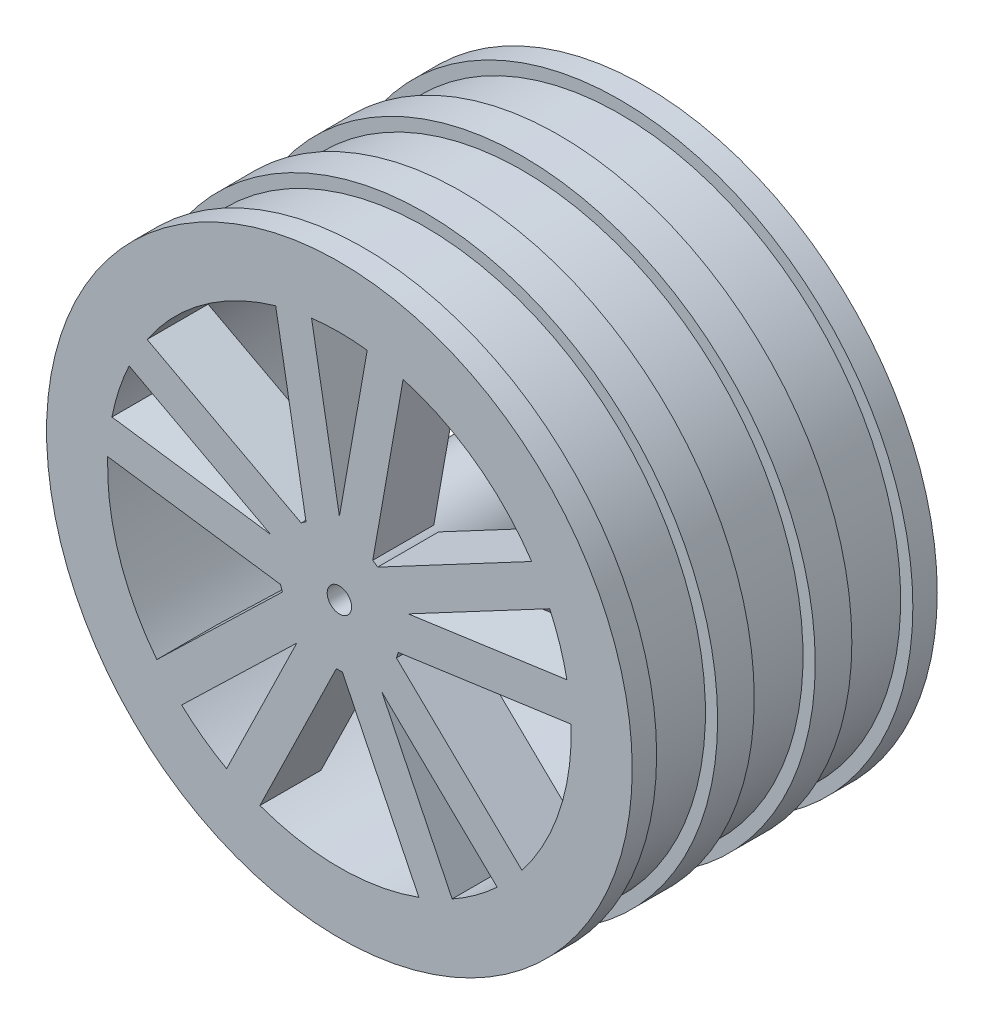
ISO-10303-21;
HEADER;
FILE_DESCRIPTION(('STEP AP214'),'2;1');
FILE_NAME('part.step','',(''),(''),'','','');
FILE_SCHEMA(('AUTOMOTIVE_DESIGN { 1 0 10303 214 1 1 1 1 }'));
ENDSEC;
DATA;
#1=APPLICATION_CONTEXT('core data for automotive mechanical design processes');
#2=APPLICATION_PROTOCOL_DEFINITION('international standard','automotive_design',2000,#1);
#3=PRODUCT_CONTEXT('',#1,'mechanical');
#4=PRODUCT('Part','Part','',(#3));
#5=PRODUCT_RELATED_PRODUCT_CATEGORY('part','',(#4));
#6=PRODUCT_DEFINITION_FORMATION('','',#4);
#7=PRODUCT_DEFINITION_CONTEXT('part definition',#1,'design');
#8=PRODUCT_DEFINITION('design','',#6,#7);
#9=PRODUCT_DEFINITION_SHAPE('','',#8);
#10=(LENGTH_UNIT() NAMED_UNIT(*) SI_UNIT(.MILLI.,.METRE.));
#11=(NAMED_UNIT(*) PLANE_ANGLE_UNIT() SI_UNIT($,.RADIAN.));
#12=(NAMED_UNIT(*) SI_UNIT($,.STERADIAN.) SOLID_ANGLE_UNIT());
#13=UNCERTAINTY_MEASURE_WITH_UNIT(LENGTH_MEASURE(1.E-05),#10,'distance_accuracy_value','');
#14=(GEOMETRIC_REPRESENTATION_CONTEXT(3) GLOBAL_UNCERTAINTY_ASSIGNED_CONTEXT((#13)) GLOBAL_UNIT_ASSIGNED_CONTEXT((#10,
#11,#12)) REPRESENTATION_CONTEXT('',''));
#15=CARTESIAN_POINT('',(0.,0.,0.));
#16=DIRECTION('',(0.,0.,1.));
#17=DIRECTION('',(1.,0.,0.));
#18=AXIS2_PLACEMENT_3D('',#15,#16,#17);
#19=CARTESIAN_POINT('',(0.,0.,29.6681300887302));
#20=DIRECTION('',(0.,0.,1.));
#21=DIRECTION('',(1.,0.,0.));
#22=AXIS2_PLACEMENT_3D('',#19,#20,#21);
#23=CYLINDRICAL_SURFACE('',#22,24.);
#24=CARTESIAN_POINT('',(0.,0.,10.5));
#25=DIRECTION('',(0.,0.,1.));
#26=DIRECTION('',(1.,0.,0.));
#27=AXIS2_PLACEMENT_3D('',#24,#25,#26);
#28=CIRCLE('',#27,24.);
#29=CARTESIAN_POINT('',(24.,0.,10.5));
#30=VERTEX_POINT('',#29);
#31=EDGE_CURVE('E49',#30,#30,#28,.T.);
#32=ORIENTED_EDGE('',*,*,#31,.T.);
#33=EDGE_LOOP('',(#32));
#34=FACE_BOUND('',#33,.T.);
#35=CARTESIAN_POINT('',(0.,0.,12.5));
#36=DIRECTION('',(0.,0.,1.));
#37=DIRECTION('',(1.,0.,0.));
#38=AXIS2_PLACEMENT_3D('',#35,#36,#37);
#39=CIRCLE('',#38,24.);
#40=CARTESIAN_POINT('',(24.,0.,12.5));
#41=VERTEX_POINT('',#40);
#42=EDGE_CURVE('E640',#41,#41,#39,.T.);
#43=ORIENTED_EDGE('',*,*,#42,.F.);
#44=EDGE_LOOP('',(#43));
#45=FACE_BOUND('',#44,.T.);
#46=ADVANCED_FACE('F45',(#34,#45),#23,.T.);
#47=CARTESIAN_POINT('',(0.,0.,-10.5));
#48=DIRECTION('',(0.,0.,-1.));
#49=DIRECTION('',(-1.,0.,0.));
#50=AXIS2_PLACEMENT_3D('',#47,#48,#49);
#51=CIRCLE('',#50,24.);
#52=CARTESIAN_POINT('',(-24.,0.,-10.5));
#53=VERTEX_POINT('',#52);
#54=EDGE_CURVE('E614',#53,#53,#51,.T.);
#55=ORIENTED_EDGE('',*,*,#54,.T.);
#56=EDGE_LOOP('',(#55));
#57=FACE_BOUND('',#56,.T.);
#58=CARTESIAN_POINT('',(0.,0.,-12.5));
#59=DIRECTION('',(0.,0.,1.));
#60=DIRECTION('',(1.,0.,0.));
#61=AXIS2_PLACEMENT_3D('',#58,#59,#60);
#62=CIRCLE('',#61,24.);
#63=CARTESIAN_POINT('',(24.,0.,-12.5));
#64=VERTEX_POINT('',#63);
#65=EDGE_CURVE('E644',#64,#64,#62,.T.);
#66=ORIENTED_EDGE('',*,*,#65,.T.);
#67=EDGE_LOOP('',(#66));
#68=FACE_BOUND('',#67,.T.);
#69=ADVANCED_FACE('F1334',(#57,#68),#23,.T.);
#70=CARTESIAN_POINT('',(0.,0.,7.5));
#71=DIRECTION('',(0.,0.,1.));
#72=DIRECTION('',(1.,0.,0.));
#73=AXIS2_PLACEMENT_3D('',#70,#71,#72);
#74=PLANE('',#73);
#75=DIRECTION('',(0.17364817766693,0.984807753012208,0.));
#76=VECTOR('',#75,1.);
#77=CARTESIAN_POINT('',(1.93969262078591,-0.34202014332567,7.5));
#78=LINE('',#77,#76);
#79=CARTESIAN_POINT('',(2.73773050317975,4.18387759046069,7.5));
#80=VERTEX_POINT('',#79);
#81=CARTESIAN_POINT('',(5.22123252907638,18.268517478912,7.5));
#82=VERTEX_POINT('',#81);
#83=EDGE_CURVE('E680',#80,#82,#78,.T.);
#84=ORIENTED_EDGE('',*,*,#83,.F.);
#85=CARTESIAN_POINT('',(0.,0.,7.5));
#86=DIRECTION('',(0.,0.,1.));
#87=DIRECTION('',(1.,0.,0.));
#88=AXIS2_PLACEMENT_3D('',#85,#86,#87);
#89=CIRCLE('',#88,5.);
#90=CARTESIAN_POINT('',(-2.73773050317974,4.1838775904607,7.5));
#91=VERTEX_POINT('',#90);
#92=EDGE_CURVE('E1111',#80,#91,#89,.T.);
#93=ORIENTED_EDGE('',*,*,#92,.T.);
#94=DIRECTION('',(-0.173648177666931,0.984807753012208,0.));
#95=VECTOR('',#94,1.);
#96=CARTESIAN_POINT('',(-1.9396926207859,-0.342020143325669,7.5));
#97=LINE('',#96,#95);
#98=CARTESIAN_POINT('',(-5.22123252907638,18.268517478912,7.5));
#99=VERTEX_POINT('',#98);
#100=EDGE_CURVE('E662',#91,#99,#97,.T.);
#101=ORIENTED_EDGE('',*,*,#100,.T.);
#102=CARTESIAN_POINT('',(0.,0.,7.5));
#103=DIRECTION('',(0.,0.,1.));
#104=DIRECTION('',(1.,0.,0.));
#105=AXIS2_PLACEMENT_3D('',#102,#103,#104);
#106=CIRCLE('',#105,19.);
#107=CARTESIAN_POINT('',(-2.27972956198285,18.8627366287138,7.5));
#108=VERTEX_POINT('',#107);
#109=EDGE_CURVE('E627',#99,#108,#106,.F.);
#110=ORIENTED_EDGE('',*,*,#109,.T.);
#111=DIRECTION('',(-0.173648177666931,0.984807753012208,0.));
#112=VECTOR('',#111,1.);
#113=CARTESIAN_POINT('',(1.01473063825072,0.178924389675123,7.5));
#114=LINE('',#113,#112);
#115=CARTESIAN_POINT('',(0.,5.93374781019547,7.5));
#116=VERTEX_POINT('',#115);
#117=EDGE_CURVE('E683',#116,#108,#114,.T.);
#118=ORIENTED_EDGE('',*,*,#117,.F.);
#119=DIRECTION('',(0.173648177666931,0.984807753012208,0.));
#120=VECTOR('',#119,1.);
#121=CARTESIAN_POINT('',(-1.01473063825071,0.178924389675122,7.5));
#122=LINE('',#121,#120);
#123=CARTESIAN_POINT('',(2.27972956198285,18.8627366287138,7.5));
#124=VERTEX_POINT('',#123);
#125=EDGE_CURVE('E666',#116,#124,#122,.T.);
#126=ORIENTED_EDGE('',*,*,#125,.T.);
#127=EDGE_CURVE('E636',#124,#82,#106,.F.);
#128=ORIENTED_EDGE('',*,*,#127,.T.);
#129=EDGE_LOOP('',(#84,#93,#101,#110,#118,#126,#128));
#130=FACE_BOUND('',#129,.T.);
#131=ADVANCED_FACE('F1340',(#130),#74,.F.);
#132=DIRECTION('',(-0.882947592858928,0.469471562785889,0.));
#133=VECTOR('',#132,1.);
#134=CARTESIAN_POINT('',(0.924678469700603,1.73906726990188,7.5));
#135=LINE('',#134,#133);
#136=CARTESIAN_POINT('',(-3.1330987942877,3.89662571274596,7.5));
#137=VERTEX_POINT('',#136);
#138=CARTESIAN_POINT('',(-15.7609430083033,10.6109695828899,7.5));
#139=VERTEX_POINT('',#138);
#140=EDGE_CURVE('E780',#137,#139,#135,.T.);
#141=ORIENTED_EDGE('',*,*,#140,.F.);
#142=CARTESIAN_POINT('',(-4.82510929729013,-1.31084715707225,7.5));
#143=VERTEX_POINT('',#142);
#144=EDGE_CURVE('E1131',#137,#143,#89,.T.);
#145=ORIENTED_EDGE('',*,*,#144,.T.);
#146=DIRECTION('',(-0.990268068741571,0.139173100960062,0.));
#147=VECTOR('',#146,1.);
#148=CARTESIAN_POINT('',(-0.27411749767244,-1.95044734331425,7.5));
#149=LINE('',#148,#147);
#150=CARTESIAN_POINT('',(-18.9878421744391,0.679595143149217,7.5));
#151=VERTEX_POINT('',#150);
#152=EDGE_CURVE('E761',#143,#151,#149,.T.);
#153=ORIENTED_EDGE('',*,*,#152,.T.);
#154=CARTESIAN_POINT('',(0.,0.,7.5));
#155=DIRECTION('',(0.,0.,1.));
#156=DIRECTION('',(1.,0.,0.));
#157=AXIS2_PLACEMENT_3D('',#154,#155,#156);
#158=CIRCLE('',#157,19.);
#159=CARTESIAN_POINT('',(-18.6440037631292,3.66075452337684,7.5));
#160=VERTEX_POINT('',#159);
#161=EDGE_CURVE('E2493',#151,#160,#158,.F.);
#162=ORIENTED_EDGE('',*,*,#161,.T.);
#163=DIRECTION('',(-0.990268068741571,0.139173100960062,0.));
#164=VECTOR('',#163,1.);
#165=CARTESIAN_POINT('',(0.143401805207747,1.02035686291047,7.5));
#166=LINE('',#165,#164);
#167=CARTESIAN_POINT('',(-5.64332952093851,1.83362891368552,7.5));
#168=VERTEX_POINT('',#167);
#169=EDGE_CURVE('E783',#168,#160,#166,.T.);
#170=ORIENTED_EDGE('',*,*,#169,.F.);
#171=DIRECTION('',(-0.882947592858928,0.469471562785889,0.));
#172=VECTOR('',#171,1.);
#173=CARTESIAN_POINT('',(-0.483736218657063,-0.909775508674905,7.5));
#174=LINE('',#173,#172);
#175=CARTESIAN_POINT('',(-17.2350534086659,7.9970578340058,7.5));
#176=VERTEX_POINT('',#175);
#177=EDGE_CURVE('E765',#168,#176,#174,.T.);
#178=ORIENTED_EDGE('',*,*,#177,.T.);
#179=EDGE_CURVE('E2496',#176,#139,#158,.F.);
#180=ORIENTED_EDGE('',*,*,#179,.T.);
#181=EDGE_LOOP('',(#141,#145,#153,#162,#170,#178,#180));
#182=FACE_BOUND('',#181,.T.);
#183=ADVANCED_FACE('F1516',(#182),#74,.F.);
#184=DIRECTION('',(-0.719339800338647,-0.694658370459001,0.));
#185=VECTOR('',#184,1.);
#186=CARTESIAN_POINT('',(-1.3682098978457,1.41682282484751,7.5));
#187=LINE('',#186,#185);
#188=CARTESIAN_POINT('',(-4.67409204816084,-1.77563045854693,7.5));
#189=VERTEX_POINT('',#188);
#190=CARTESIAN_POINT('',(-14.9620310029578,-11.7105776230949,7.5));
#191=VERTEX_POINT('',#190);
#192=EDGE_CURVE('E811',#189,#191,#187,.T.);
#193=ORIENTED_EDGE('',*,*,#192,.F.);
#194=CARTESIAN_POINT('',(-0.244351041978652,-4.99402568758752,7.5));
#195=VERTEX_POINT('',#194);
#196=EDGE_CURVE('E1116',#189,#195,#89,.T.);
#197=ORIENTED_EDGE('',*,*,#196,.T.);
#198=DIRECTION('',(-0.438371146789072,-0.89879404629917,0.));
#199=VECTOR('',#198,1.);
#200=CARTESIAN_POINT('',(1.77027869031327,-0.86342260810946,7.5));
#201=LINE('',#200,#199);
#202=CARTESIAN_POINT('',(-6.51389930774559,-17.8485045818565,7.5));
#203=VERTEX_POINT('',#202);
#204=EDGE_CURVE('E792',#195,#203,#201,.T.);
#205=ORIENTED_EDGE('',*,*,#204,.T.);
#206=CARTESIAN_POINT('',(-9.24289845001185,-16.600265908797,7.5));
#207=VERTEX_POINT('',#206);
#208=EDGE_CURVE('E2487',#203,#207,#158,.F.);
#209=ORIENTED_EDGE('',*,*,#208,.T.);
#210=DIRECTION('',(-0.438371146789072,-0.89879404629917,0.));
#211=VECTOR('',#210,1.);
#212=CARTESIAN_POINT('',(-0.92610344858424,0.451690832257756,7.5));
#213=LINE('',#212,#211);
#214=CARTESIAN_POINT('',(-3.48776945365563,-4.80050281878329,7.5));
#215=VERTEX_POINT('',#214);
#216=EDGE_CURVE('E814',#215,#207,#213,.T.);
#217=ORIENTED_EDGE('',*,*,#216,.F.);
#218=DIRECTION('',(-0.719339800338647,-0.694658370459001,0.));
#219=VECTOR('',#218,1.);
#220=CARTESIAN_POINT('',(0.7157652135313,-0.741196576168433,7.5));
#221=LINE('',#220,#219);
#222=CARTESIAN_POINT('',(-12.931578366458,-13.9202830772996,7.5));
#223=VERTEX_POINT('',#222);
#224=EDGE_CURVE('E796',#215,#223,#221,.T.);
#225=ORIENTED_EDGE('',*,*,#224,.T.);
#226=EDGE_CURVE('E2490',#223,#191,#158,.F.);
#227=ORIENTED_EDGE('',*,*,#226,.T.);
#228=EDGE_LOOP('',(#193,#197,#205,#209,#217,#225,#227));
#229=FACE_BOUND('',#228,.T.);
#230=ADVANCED_FACE('F1525',(#229),#74,.F.);
#231=DIRECTION('',(0.438371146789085,-0.898794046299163,0.));
#232=VECTOR('',#231,1.);
#233=CARTESIAN_POINT('',(-1.77027869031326,-0.863422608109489,7.5));
#234=LINE('',#233,#232);
#235=CARTESIAN_POINT('',(0.244351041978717,-4.99402568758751,7.5));
#236=VERTEX_POINT('',#235);
#237=CARTESIAN_POINT('',(6.51389930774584,-17.8485045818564,7.5));
#238=VERTEX_POINT('',#237);
#239=EDGE_CURVE('E841',#236,#238,#234,.T.);
#240=ORIENTED_EDGE('',*,*,#239,.F.);
#241=CARTESIAN_POINT('',(4.67409204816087,-1.77563045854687,7.5));
#242=VERTEX_POINT('',#241);
#243=EDGE_CURVE('E1124',#236,#242,#89,.T.);
#244=ORIENTED_EDGE('',*,*,#243,.T.);
#245=DIRECTION('',(0.719339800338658,-0.694658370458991,0.));
#246=VECTOR('',#245,1.);
#247=CARTESIAN_POINT('',(1.36820989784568,1.41682282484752,7.5));
#248=LINE('',#247,#246);
#249=CARTESIAN_POINT('',(14.9620310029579,-11.7105776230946,7.5));
#250=VERTEX_POINT('',#249);
#251=EDGE_CURVE('E822',#242,#250,#248,.T.);
#252=ORIENTED_EDGE('',*,*,#251,.T.);
#253=CARTESIAN_POINT('',(12.9315783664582,-13.9202830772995,7.5));
#254=VERTEX_POINT('',#253);
#255=EDGE_CURVE('E752',#250,#254,#158,.F.);
#256=ORIENTED_EDGE('',*,*,#255,.T.);
#257=DIRECTION('',(0.719339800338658,-0.694658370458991,0.));
#258=VECTOR('',#257,1.);
#259=CARTESIAN_POINT('',(-0.715765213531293,-0.741196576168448,7.5));
#260=LINE('',#259,#258);
#261=CARTESIAN_POINT('',(3.4877694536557,-4.80050281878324,7.5));
#262=VERTEX_POINT('',#261);
#263=EDGE_CURVE('E844',#262,#254,#260,.T.);
#264=ORIENTED_EDGE('',*,*,#263,.F.);
#265=DIRECTION('',(0.438371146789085,-0.898794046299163,0.));
#266=VECTOR('',#265,1.);
#267=CARTESIAN_POINT('',(0.926103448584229,0.451690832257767,7.5));
#268=LINE('',#267,#266);
#269=CARTESIAN_POINT('',(9.24289845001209,-16.6002659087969,7.5));
#270=VERTEX_POINT('',#269);
#271=EDGE_CURVE('E826',#262,#270,#268,.T.);
#272=ORIENTED_EDGE('',*,*,#271,.T.);
#273=EDGE_CURVE('E2484',#270,#238,#158,.F.);
#274=ORIENTED_EDGE('',*,*,#273,.T.);
#275=EDGE_LOOP('',(#240,#244,#252,#256,#264,#272,#274));
#276=FACE_BOUND('',#275,.T.);
#277=ADVANCED_FACE('F1532',(#276),#74,.F.);
#278=CARTESIAN_POINT('',(0.,0.,-7.5));
#279=DIRECTION('',(0.,0.,-1.));
#280=DIRECTION('',(1.,0.,0.));
#281=AXIS2_PLACEMENT_3D('',#278,#279,#280);
#282=PLANE('',#281);
#283=DIRECTION('',(-0.173648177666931,0.984807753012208,0.));
#284=VECTOR('',#283,1.);
#285=CARTESIAN_POINT('',(-1.9396926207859,-0.342020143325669,-7.5));
#286=LINE('',#285,#284);
#287=CARTESIAN_POINT('',(-2.73773050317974,4.1838775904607,-7.5));
#288=VERTEX_POINT('',#287);
#289=CARTESIAN_POINT('',(-5.22123252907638,18.268517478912,-7.5));
#290=VERTEX_POINT('',#289);
#291=EDGE_CURVE('E966',#288,#290,#286,.T.);
#292=ORIENTED_EDGE('',*,*,#291,.F.);
#293=CARTESIAN_POINT('',(0.,0.,-7.5));
#294=DIRECTION('',(0.,0.,-1.));
#295=DIRECTION('',(-1.,0.,0.));
#296=AXIS2_PLACEMENT_3D('',#293,#294,#295);
#297=CIRCLE('',#296,5.);
#298=CARTESIAN_POINT('',(2.73773050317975,4.18387759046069,-7.5));
#299=VERTEX_POINT('',#298);
#300=EDGE_CURVE('E520',#288,#299,#297,.T.);
#301=ORIENTED_EDGE('',*,*,#300,.T.);
#302=DIRECTION('',(0.17364817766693,0.984807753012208,0.));
#303=VECTOR('',#302,1.);
#304=CARTESIAN_POINT('',(1.93969262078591,-0.34202014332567,-7.5));
#305=LINE('',#304,#303);
#306=CARTESIAN_POINT('',(5.22123252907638,18.268517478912,-7.5));
#307=VERTEX_POINT('',#306);
#308=EDGE_CURVE('E983',#299,#307,#305,.T.);
#309=ORIENTED_EDGE('',*,*,#308,.T.);
#310=CARTESIAN_POINT('',(0.,0.,-7.5));
#311=DIRECTION('',(0.,0.,-1.));
#312=DIRECTION('',(-1.,0.,0.));
#313=AXIS2_PLACEMENT_3D('',#310,#311,#312);
#314=CIRCLE('',#313,19.);
#315=CARTESIAN_POINT('',(2.27972956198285,18.8627366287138,-7.5));
#316=VERTEX_POINT('',#315);
#317=EDGE_CURVE('E1191',#307,#316,#314,.F.);
#318=ORIENTED_EDGE('',*,*,#317,.T.);
#319=DIRECTION('',(0.173648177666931,0.984807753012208,0.));
#320=VECTOR('',#319,1.);
#321=CARTESIAN_POINT('',(-1.01473063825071,0.178924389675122,-7.5));
#322=LINE('',#321,#320);
#323=CARTESIAN_POINT('',(0.,5.93374781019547,-7.5));
#324=VERTEX_POINT('',#323);
#325=EDGE_CURVE('E986',#324,#316,#322,.T.);
#326=ORIENTED_EDGE('',*,*,#325,.F.);
#327=DIRECTION('',(-0.173648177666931,0.984807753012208,0.));
#328=VECTOR('',#327,1.);
#329=CARTESIAN_POINT('',(1.01473063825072,0.178924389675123,-7.5));
#330=LINE('',#329,#328);
#331=CARTESIAN_POINT('',(-2.27972956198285,18.8627366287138,-7.5));
#332=VERTEX_POINT('',#331);
#333=EDGE_CURVE('E970',#324,#332,#330,.T.);
#334=ORIENTED_EDGE('',*,*,#333,.T.);
#335=EDGE_CURVE('E1196',#332,#290,#314,.F.);
#336=ORIENTED_EDGE('',*,*,#335,.T.);
#337=EDGE_LOOP('',(#292,#301,#309,#318,#326,#334,#336));
#338=FACE_BOUND('',#337,.T.);
#339=ADVANCED_FACE('F1539',(#338),#282,.F.);
#340=DIRECTION('',(0.882947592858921,0.469471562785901,0.));
#341=VECTOR('',#340,1.);
#342=CARTESIAN_POINT('',(-0.924678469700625,1.73906726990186,-7.5));
#343=LINE('',#342,#341);
#344=CARTESIAN_POINT('',(3.13309879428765,3.896625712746,-7.5));
#345=VERTEX_POINT('',#344);
#346=CARTESIAN_POINT('',(15.7609430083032,10.6109695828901,-7.5));
#347=VERTEX_POINT('',#346);
#348=EDGE_CURVE('E1085',#345,#347,#343,.T.);
#349=ORIENTED_EDGE('',*,*,#348,.F.);
#350=CARTESIAN_POINT('',(4.82510929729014,-1.31084715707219,-7.5));
#351=VERTEX_POINT('',#350);
#352=EDGE_CURVE('E512',#345,#351,#297,.T.);
#353=ORIENTED_EDGE('',*,*,#352,.T.);
#354=DIRECTION('',(0.990268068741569,0.139173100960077,0.));
#355=VECTOR('',#354,1.);
#356=CARTESIAN_POINT('',(0.274117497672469,-1.95044734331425,-7.5));
#357=LINE('',#356,#355);
#358=CARTESIAN_POINT('',(18.9878421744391,0.679595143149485,-7.5));
#359=VERTEX_POINT('',#358);
#360=EDGE_CURVE('E503',#351,#359,#357,.T.);
#361=ORIENTED_EDGE('',*,*,#360,.T.);
#362=CARTESIAN_POINT('',(18.6440037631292,3.6607545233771,-7.5));
#363=VERTEX_POINT('',#362);
#364=EDGE_CURVE('E1190',#359,#363,#314,.F.);
#365=ORIENTED_EDGE('',*,*,#364,.T.);
#366=DIRECTION('',(0.990268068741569,0.139173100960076,0.));
#367=VECTOR('',#366,1.);
#368=CARTESIAN_POINT('',(-0.143401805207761,1.02035686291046,-7.5));
#369=LINE('',#368,#367);
#370=CARTESIAN_POINT('',(5.64332952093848,1.83362891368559,-7.5));
#371=VERTEX_POINT('',#370);
#372=EDGE_CURVE('E1101',#371,#363,#369,.T.);
#373=ORIENTED_EDGE('',*,*,#372,.F.);
#374=DIRECTION('',(0.882947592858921,0.469471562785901,0.));
#375=VECTOR('',#374,1.);
#376=CARTESIAN_POINT('',(0.483736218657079,-0.909775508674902,-7.5));
#377=LINE('',#376,#375);
#378=CARTESIAN_POINT('',(17.2350534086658,7.99705783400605,-7.5));
#379=VERTEX_POINT('',#378);
#380=EDGE_CURVE('E1087',#371,#379,#377,.T.);
#381=ORIENTED_EDGE('',*,*,#380,.T.);
#382=EDGE_CURVE('E1185',#379,#347,#314,.F.);
#383=ORIENTED_EDGE('',*,*,#382,.T.);
#384=EDGE_LOOP('',(#349,#353,#361,#365,#373,#381,#383));
#385=FACE_BOUND('',#384,.T.);
#386=ADVANCED_FACE('F1184',(#385),#282,.F.);
#387=DIRECTION('',(0.719339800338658,-0.694658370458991,0.));
#388=VECTOR('',#387,1.);
#389=CARTESIAN_POINT('',(1.36820989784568,1.41682282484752,-7.5));
#390=LINE('',#389,#388);
#391=CARTESIAN_POINT('',(4.67409204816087,-1.77563045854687,-7.5));
#392=VERTEX_POINT('',#391);
#393=CARTESIAN_POINT('',(14.9620310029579,-11.7105776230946,-7.5));
#394=VERTEX_POINT('',#393);
#395=EDGE_CURVE('E1055',#392,#394,#390,.T.);
#396=ORIENTED_EDGE('',*,*,#395,.F.);
#397=CARTESIAN_POINT('',(0.244351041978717,-4.99402568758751,-7.5));
#398=VERTEX_POINT('',#397);
#399=EDGE_CURVE('E521',#392,#398,#297,.T.);
#400=ORIENTED_EDGE('',*,*,#399,.T.);
#401=DIRECTION('',(0.438371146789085,-0.898794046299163,0.));
#402=VECTOR('',#401,1.);
#403=CARTESIAN_POINT('',(-1.77027869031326,-0.863422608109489,-7.5));
#404=LINE('',#403,#402);
#405=CARTESIAN_POINT('',(6.51389930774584,-17.8485045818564,-7.5));
#406=VERTEX_POINT('',#405);
#407=EDGE_CURVE('E1074',#398,#406,#404,.T.);
#408=ORIENTED_EDGE('',*,*,#407,.T.);
#409=CARTESIAN_POINT('',(9.24289845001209,-16.6002659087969,-7.5));
#410=VERTEX_POINT('',#409);
#411=EDGE_CURVE('E1255',#406,#410,#314,.F.);
#412=ORIENTED_EDGE('',*,*,#411,.T.);
#413=DIRECTION('',(0.438371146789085,-0.898794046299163,0.));
#414=VECTOR('',#413,1.);
#415=CARTESIAN_POINT('',(0.926103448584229,0.451690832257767,-7.5));
#416=LINE('',#415,#414);
#417=CARTESIAN_POINT('',(3.4877694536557,-4.80050281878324,-7.5));
#418=VERTEX_POINT('',#417);
#419=EDGE_CURVE('E1077',#418,#410,#416,.T.);
#420=ORIENTED_EDGE('',*,*,#419,.F.);
#421=DIRECTION('',(0.719339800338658,-0.694658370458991,0.));
#422=VECTOR('',#421,1.);
#423=CARTESIAN_POINT('',(-0.715765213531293,-0.741196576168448,-7.5));
#424=LINE('',#423,#422);
#425=CARTESIAN_POINT('',(12.9315783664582,-13.9202830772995,-7.5));
#426=VERTEX_POINT('',#425);
#427=EDGE_CURVE('E1059',#418,#426,#424,.T.);
#428=ORIENTED_EDGE('',*,*,#427,.T.);
#429=EDGE_CURVE('E1195',#426,#394,#314,.F.);
#430=ORIENTED_EDGE('',*,*,#429,.T.);
#431=EDGE_LOOP('',(#396,#400,#408,#412,#420,#428,#430));
#432=FACE_BOUND('',#431,.T.);
#433=ADVANCED_FACE('F1265',(#432),#282,.F.);
#434=DIRECTION('',(-0.438371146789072,-0.89879404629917,0.));
#435=VECTOR('',#434,1.);
#436=CARTESIAN_POINT('',(1.77027869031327,-0.86342260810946,-7.5));
#437=LINE('',#436,#435);
#438=CARTESIAN_POINT('',(-0.244351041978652,-4.99402568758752,-7.5));
#439=VERTEX_POINT('',#438);
#440=CARTESIAN_POINT('',(-6.51389930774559,-17.8485045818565,-7.5));
#441=VERTEX_POINT('',#440);
#442=EDGE_CURVE('E1025',#439,#441,#437,.T.);
#443=ORIENTED_EDGE('',*,*,#442,.F.);
#444=CARTESIAN_POINT('',(-4.67409204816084,-1.77563045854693,-7.5));
#445=VERTEX_POINT('',#444);
#446=EDGE_CURVE('E1166',#439,#445,#297,.T.);
#447=ORIENTED_EDGE('',*,*,#446,.T.);
#448=DIRECTION('',(-0.719339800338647,-0.694658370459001,0.));
#449=VECTOR('',#448,1.);
#450=CARTESIAN_POINT('',(-1.3682098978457,1.41682282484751,-7.5));
#451=LINE('',#450,#449);
#452=CARTESIAN_POINT('',(-14.9620310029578,-11.7105776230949,-7.5));
#453=VERTEX_POINT('',#452);
#454=EDGE_CURVE('E1044',#445,#453,#451,.T.);
#455=ORIENTED_EDGE('',*,*,#454,.T.);
#456=CARTESIAN_POINT('',(-12.931578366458,-13.9202830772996,-7.5));
#457=VERTEX_POINT('',#456);
#458=EDGE_CURVE('E868',#453,#457,#314,.F.);
#459=ORIENTED_EDGE('',*,*,#458,.T.);
#460=DIRECTION('',(-0.719339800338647,-0.694658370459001,0.));
#461=VECTOR('',#460,1.);
#462=CARTESIAN_POINT('',(0.7157652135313,-0.741196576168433,-7.5));
#463=LINE('',#462,#461);
#464=CARTESIAN_POINT('',(-3.48776945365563,-4.80050281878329,-7.5));
#465=VERTEX_POINT('',#464);
#466=EDGE_CURVE('E1047',#465,#457,#463,.T.);
#467=ORIENTED_EDGE('',*,*,#466,.F.);
#468=DIRECTION('',(-0.438371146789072,-0.89879404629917,0.));
#469=VECTOR('',#468,1.);
#470=CARTESIAN_POINT('',(-0.92610344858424,0.451690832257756,-7.5));
#471=LINE('',#470,#469);
#472=CARTESIAN_POINT('',(-9.24289845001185,-16.600265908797,-7.5));
#473=VERTEX_POINT('',#472);
#474=EDGE_CURVE('E1029',#465,#473,#471,.T.);
#475=ORIENTED_EDGE('',*,*,#474,.T.);
#476=EDGE_CURVE('E1252',#473,#441,#314,.F.);
#477=ORIENTED_EDGE('',*,*,#476,.T.);
#478=EDGE_LOOP('',(#443,#447,#455,#459,#467,#475,#477));
#479=FACE_BOUND('',#478,.T.);
#480=ADVANCED_FACE('F1557',(#479),#282,.F.);
#481=CARTESIAN_POINT('',(0.,0.,29.6681300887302));
#482=DIRECTION('',(0.,0.,1.));
#483=DIRECTION('',(1.,0.,0.));
#484=AXIS2_PLACEMENT_3D('',#481,#482,#483);
#485=CYLINDRICAL_SURFACE('',#484,19.);
#486=DIRECTION('',(0.,0.,1.));
#487=VECTOR('',#486,1.);
#488=CARTESIAN_POINT('',(-18.9878421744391,0.679595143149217,29.6681300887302));
#489=LINE('',#488,#487);
#490=CARTESIAN_POINT('',(-18.9878421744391,0.679595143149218,12.5));
#491=VERTEX_POINT('',#490);
#492=EDGE_CURVE('E720',#491,#151,#489,.F.);
#493=ORIENTED_EDGE('',*,*,#492,.F.);
#494=CARTESIAN_POINT('',(0.,0.,12.5));
#495=DIRECTION('',(0.,0.,1.));
#496=DIRECTION('',(1.,0.,0.));
#497=AXIS2_PLACEMENT_3D('',#494,#495,#496);
#498=CIRCLE('',#497,19.);
#499=CARTESIAN_POINT('',(-14.9620310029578,-11.7105776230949,12.5));
#500=VERTEX_POINT('',#499);
#501=EDGE_CURVE('E2520',#491,#500,#498,.T.);
#502=ORIENTED_EDGE('',*,*,#501,.T.);
#503=DIRECTION('',(0.,0.,1.));
#504=VECTOR('',#503,1.);
#505=CARTESIAN_POINT('',(-14.9620310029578,-11.7105776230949,29.6681300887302));
#506=LINE('',#505,#504);
#507=EDGE_CURVE('E724',#500,#191,#506,.F.);
#508=ORIENTED_EDGE('',*,*,#507,.T.);
#509=ORIENTED_EDGE('',*,*,#226,.F.);
#510=DIRECTION('',(0.,0.,1.));
#511=VECTOR('',#510,1.);
#512=CARTESIAN_POINT('',(-12.931578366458,-13.9202830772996,29.6681300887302));
#513=LINE('',#512,#511);
#514=CARTESIAN_POINT('',(-12.931578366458,-13.9202830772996,12.5));
#515=VERTEX_POINT('',#514);
#516=EDGE_CURVE('E700',#515,#223,#513,.F.);
#517=ORIENTED_EDGE('',*,*,#516,.F.);
#518=CARTESIAN_POINT('',(-9.24289845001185,-16.600265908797,12.5));
#519=VERTEX_POINT('',#518);
#520=EDGE_CURVE('E2523',#515,#519,#498,.T.);
#521=ORIENTED_EDGE('',*,*,#520,.T.);
#522=DIRECTION('',(0.,0.,1.));
#523=VECTOR('',#522,1.);
#524=CARTESIAN_POINT('',(-9.24289845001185,-16.600265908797,29.6681300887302));
#525=LINE('',#524,#523);
#526=EDGE_CURVE('E696',#519,#207,#525,.F.);
#527=ORIENTED_EDGE('',*,*,#526,.T.);
#528=ORIENTED_EDGE('',*,*,#208,.F.);
#529=DIRECTION('',(0.,0.,1.));
#530=VECTOR('',#529,1.);
#531=CARTESIAN_POINT('',(-6.51389930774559,-17.8485045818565,29.6681300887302));
#532=LINE('',#531,#530);
#533=CARTESIAN_POINT('',(-6.51389930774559,-17.8485045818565,12.5));
#534=VERTEX_POINT('',#533);
#535=EDGE_CURVE('E728',#534,#203,#532,.F.);
#536=ORIENTED_EDGE('',*,*,#535,.F.);
#537=CARTESIAN_POINT('',(6.51389930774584,-17.8485045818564,12.5));
#538=VERTEX_POINT('',#537);
#539=EDGE_CURVE('E2477',#534,#538,#498,.T.);
#540=ORIENTED_EDGE('',*,*,#539,.T.);
#541=DIRECTION('',(0.,0.,1.));
#542=VECTOR('',#541,1.);
#543=CARTESIAN_POINT('',(6.51389930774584,-17.8485045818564,29.6681300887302));
#544=LINE('',#543,#542);
#545=EDGE_CURVE('E732',#538,#238,#544,.F.);
#546=ORIENTED_EDGE('',*,*,#545,.T.);
#547=ORIENTED_EDGE('',*,*,#273,.F.);
#548=DIRECTION('',(0.,0.,1.));
#549=VECTOR('',#548,1.);
#550=CARTESIAN_POINT('',(9.24289845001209,-16.6002659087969,29.6681300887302));
#551=LINE('',#550,#549);
#552=CARTESIAN_POINT('',(9.24289845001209,-16.6002659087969,12.5));
#553=VERTEX_POINT('',#552);
#554=EDGE_CURVE('E708',#553,#270,#551,.F.);
#555=ORIENTED_EDGE('',*,*,#554,.F.);
#556=CARTESIAN_POINT('',(12.9315783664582,-13.9202830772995,12.5));
#557=VERTEX_POINT('',#556);
#558=EDGE_CURVE('E2472',#553,#557,#498,.T.);
#559=ORIENTED_EDGE('',*,*,#558,.T.);
#560=DIRECTION('',(0.,0.,1.));
#561=VECTOR('',#560,1.);
#562=CARTESIAN_POINT('',(12.9315783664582,-13.9202830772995,29.6681300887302));
#563=LINE('',#562,#561);
#564=EDGE_CURVE('E704',#557,#254,#563,.F.);
#565=ORIENTED_EDGE('',*,*,#564,.T.);
#566=ORIENTED_EDGE('',*,*,#255,.F.);
#567=DIRECTION('',(0.,0.,1.));
#568=VECTOR('',#567,1.);
#569=CARTESIAN_POINT('',(14.9620310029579,-11.7105776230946,29.6681300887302));
#570=LINE('',#569,#568);
#571=CARTESIAN_POINT('',(14.9620310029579,-11.7105776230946,12.5));
#572=VERTEX_POINT('',#571);
#573=EDGE_CURVE('E736',#572,#250,#570,.F.);
#574=ORIENTED_EDGE('',*,*,#573,.F.);
#575=CARTESIAN_POINT('',(18.9878421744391,0.679595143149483,12.5));
#576=VERTEX_POINT('',#575);
#577=EDGE_CURVE('E2469',#572,#576,#498,.T.);
#578=ORIENTED_EDGE('',*,*,#577,.T.);
#579=DIRECTION('',(0.,0.,1.));
#580=VECTOR('',#579,1.);
#581=CARTESIAN_POINT('',(18.9878421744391,0.679595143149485,29.6681300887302));
#582=LINE('',#581,#580);
#583=CARTESIAN_POINT('',(18.9878421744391,0.679595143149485,7.5));
#584=VERTEX_POINT('',#583);
#585=EDGE_CURVE('E740',#576,#584,#582,.F.);
#586=ORIENTED_EDGE('',*,*,#585,.T.);
#587=CARTESIAN_POINT('',(18.6440037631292,3.6607545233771,7.5));
#588=VERTEX_POINT('',#587);
#589=EDGE_CURVE('E753',#588,#584,#158,.F.);
#590=ORIENTED_EDGE('',*,*,#589,.F.);
#591=DIRECTION('',(0.,0.,1.));
#592=VECTOR('',#591,1.);
#593=CARTESIAN_POINT('',(18.6440037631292,3.6607545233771,29.6681300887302));
#594=LINE('',#593,#592);
#595=CARTESIAN_POINT('',(18.6440037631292,3.66075452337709,12.5));
#596=VERTEX_POINT('',#595);
#597=EDGE_CURVE('E716',#596,#588,#594,.F.);
#598=ORIENTED_EDGE('',*,*,#597,.F.);
#599=CARTESIAN_POINT('',(17.2350534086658,7.99705783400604,12.5));
#600=VERTEX_POINT('',#599);
#601=EDGE_CURVE('E2473',#596,#600,#498,.T.);
#602=ORIENTED_EDGE('',*,*,#601,.T.);
#603=DIRECTION('',(0.,0.,1.));
#604=VECTOR('',#603,1.);
#605=CARTESIAN_POINT('',(17.2350534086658,7.99705783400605,29.6681300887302));
#606=LINE('',#605,#604);
#607=CARTESIAN_POINT('',(17.2350534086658,7.99705783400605,7.5));
#608=VERTEX_POINT('',#607);
#609=EDGE_CURVE('E712',#600,#608,#606,.F.);
#610=ORIENTED_EDGE('',*,*,#609,.T.);
#611=CARTESIAN_POINT('',(15.7609430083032,10.6109695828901,7.5));
#612=VERTEX_POINT('',#611);
#613=EDGE_CURVE('E757',#612,#608,#158,.F.);
#614=ORIENTED_EDGE('',*,*,#613,.F.);
#615=DIRECTION('',(0.,0.,1.));
#616=VECTOR('',#615,1.);
#617=CARTESIAN_POINT('',(15.7609430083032,10.6109695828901,29.6681300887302));
#618=LINE('',#617,#616);
#619=CARTESIAN_POINT('',(15.7609430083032,10.6109695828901,12.5));
#620=VERTEX_POINT('',#619);
#621=EDGE_CURVE('E748',#620,#612,#618,.F.);
#622=ORIENTED_EDGE('',*,*,#621,.F.);
#623=CARTESIAN_POINT('',(5.22123252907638,18.268517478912,12.5));
#624=VERTEX_POINT('',#623);
#625=EDGE_CURVE('E658',#620,#624,#498,.T.);
#626=ORIENTED_EDGE('',*,*,#625,.T.);
#627=DIRECTION('',(0.,0.,1.));
#628=VECTOR('',#627,1.);
#629=CARTESIAN_POINT('',(5.22123252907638,18.268517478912,29.6681300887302));
#630=LINE('',#629,#628);
#631=EDGE_CURVE('E628',#624,#82,#630,.F.);
#632=ORIENTED_EDGE('',*,*,#631,.T.);
#633=ORIENTED_EDGE('',*,*,#127,.F.);
#634=DIRECTION('',(0.,0.,1.));
#635=VECTOR('',#634,1.);
#636=CARTESIAN_POINT('',(2.27972956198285,18.8627366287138,29.6681300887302));
#637=LINE('',#636,#635);
#638=CARTESIAN_POINT('',(2.27972956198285,18.8627366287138,12.5));
#639=VERTEX_POINT('',#638);
#640=EDGE_CURVE('E632',#639,#124,#637,.F.);
#641=ORIENTED_EDGE('',*,*,#640,.F.);
#642=CARTESIAN_POINT('',(-2.27972956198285,18.8627366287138,12.5));
#643=VERTEX_POINT('',#642);
#644=EDGE_CURVE('E652',#639,#643,#498,.T.);
#645=ORIENTED_EDGE('',*,*,#644,.T.);
#646=DIRECTION('',(0.,0.,1.));
#647=VECTOR('',#646,1.);
#648=CARTESIAN_POINT('',(-2.27972956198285,18.8627366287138,29.6681300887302));
#649=LINE('',#648,#647);
#650=EDGE_CURVE('E624',#643,#108,#649,.F.);
#651=ORIENTED_EDGE('',*,*,#650,.T.);
#652=ORIENTED_EDGE('',*,*,#109,.F.);
#653=DIRECTION('',(0.,0.,1.));
#654=VECTOR('',#653,1.);
#655=CARTESIAN_POINT('',(-5.22123252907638,18.268517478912,29.6681300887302));
#656=LINE('',#655,#654);
#657=CARTESIAN_POINT('',(-5.22123252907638,18.268517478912,12.5));
#658=VERTEX_POINT('',#657);
#659=EDGE_CURVE('E55',#658,#99,#656,.F.);
#660=ORIENTED_EDGE('',*,*,#659,.F.);
#661=CARTESIAN_POINT('',(-15.7609430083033,10.6109695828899,12.5));
#662=VERTEX_POINT('',#661);
#663=EDGE_CURVE('E653',#658,#662,#498,.T.);
#664=ORIENTED_EDGE('',*,*,#663,.T.);
#665=DIRECTION('',(0.,0.,1.));
#666=VECTOR('',#665,1.);
#667=CARTESIAN_POINT('',(-15.7609430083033,10.6109695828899,29.6681300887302));
#668=LINE('',#667,#666);
#669=EDGE_CURVE('E744',#662,#139,#668,.F.);
#670=ORIENTED_EDGE('',*,*,#669,.T.);
#671=ORIENTED_EDGE('',*,*,#179,.F.);
#672=DIRECTION('',(0.,0.,1.));
#673=VECTOR('',#672,1.);
#674=CARTESIAN_POINT('',(-17.2350534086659,7.99705783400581,29.6681300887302));
#675=LINE('',#674,#673);
#676=CARTESIAN_POINT('',(-17.2350534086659,7.99705783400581,12.5));
#677=VERTEX_POINT('',#676);
#678=EDGE_CURVE('E692',#677,#176,#675,.F.);
#679=ORIENTED_EDGE('',*,*,#678,.F.);
#680=CARTESIAN_POINT('',(-18.6440037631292,3.66075452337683,12.5));
#681=VERTEX_POINT('',#680);
#682=EDGE_CURVE('E657',#677,#681,#498,.T.);
#683=ORIENTED_EDGE('',*,*,#682,.T.);
#684=DIRECTION('',(0.,0.,1.));
#685=VECTOR('',#684,1.);
#686=CARTESIAN_POINT('',(-18.6440037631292,3.66075452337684,29.6681300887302));
#687=LINE('',#686,#685);
#688=EDGE_CURVE('E677',#681,#160,#687,.F.);
#689=ORIENTED_EDGE('',*,*,#688,.T.);
#690=ORIENTED_EDGE('',*,*,#161,.F.);
#691=EDGE_LOOP('',(#493,#502,#508,#509,#517,#521,#527,#528,#536,#540,#546,#547,#555,#559,#565,
#566,#574,#578,#586,#590,#598,#602,#610,#614,#622,#626,#632,#633,#641,#645,#651,#652,#660,#664,
#670,#671,#679,#683,#689,#690));
#692=FACE_BOUND('',#691,.T.);
#693=DIRECTION('',(0.,0.,1.));
#694=VECTOR('',#693,1.);
#695=CARTESIAN_POINT('',(5.22123252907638,18.268517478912,29.6681300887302));
#696=LINE('',#695,#694);
#697=CARTESIAN_POINT('',(5.22123252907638,18.268517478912,-12.5));
#698=VERTEX_POINT('',#697);
#699=EDGE_CURVE('E889',#698,#307,#696,.T.);
#700=ORIENTED_EDGE('',*,*,#699,.F.);
#701=CARTESIAN_POINT('',(0.,0.,-12.5));
#702=DIRECTION('',(0.,0.,1.));
#703=DIRECTION('',(1.,0.,0.));
#704=AXIS2_PLACEMENT_3D('',#701,#702,#703);
#705=CIRCLE('',#704,19.);
#706=CARTESIAN_POINT('',(15.7609430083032,10.6109695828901,-12.5));
#707=VERTEX_POINT('',#706);
#708=EDGE_CURVE('E1300',#707,#698,#705,.T.);
#709=ORIENTED_EDGE('',*,*,#708,.F.);
#710=DIRECTION('',(0.,0.,1.));
#711=VECTOR('',#710,1.);
#712=CARTESIAN_POINT('',(15.7609430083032,10.6109695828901,29.6681300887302));
#713=LINE('',#712,#711);
#714=EDGE_CURVE('E900',#707,#347,#713,.T.);
#715=ORIENTED_EDGE('',*,*,#714,.T.);
#716=ORIENTED_EDGE('',*,*,#382,.F.);
#717=DIRECTION('',(0.,0.,1.));
#718=VECTOR('',#717,1.);
#719=CARTESIAN_POINT('',(17.2350534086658,7.99705783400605,29.6681300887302));
#720=LINE('',#719,#718);
#721=CARTESIAN_POINT('',(17.2350534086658,7.99705783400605,-12.5));
#722=VERTEX_POINT('',#721);
#723=EDGE_CURVE('E959',#722,#379,#720,.T.);
#724=ORIENTED_EDGE('',*,*,#723,.F.);
#725=CARTESIAN_POINT('',(18.6440037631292,3.6607545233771,-12.5));
#726=VERTEX_POINT('',#725);
#727=EDGE_CURVE('E648',#726,#722,#705,.T.);
#728=ORIENTED_EDGE('',*,*,#727,.F.);
#729=DIRECTION('',(0.,0.,1.));
#730=VECTOR('',#729,1.);
#731=CARTESIAN_POINT('',(18.6440037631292,3.6607545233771,29.6681300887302));
#732=LINE('',#731,#730);
#733=EDGE_CURVE('E955',#726,#363,#732,.T.);
#734=ORIENTED_EDGE('',*,*,#733,.T.);
#735=ORIENTED_EDGE('',*,*,#364,.F.);
#736=DIRECTION('',(0.,0.,1.));
#737=VECTOR('',#736,1.);
#738=CARTESIAN_POINT('',(18.9878421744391,0.679595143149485,29.6681300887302));
#739=LINE('',#738,#737);
#740=CARTESIAN_POINT('',(18.9878421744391,0.679595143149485,-12.5));
#741=VERTEX_POINT('',#740);
#742=EDGE_CURVE('E952',#741,#359,#739,.T.);
#743=ORIENTED_EDGE('',*,*,#742,.F.);
#744=CARTESIAN_POINT('',(14.9620310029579,-11.7105776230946,-12.5));
#745=VERTEX_POINT('',#744);
#746=EDGE_CURVE('E492',#745,#741,#705,.T.);
#747=ORIENTED_EDGE('',*,*,#746,.F.);
#748=DIRECTION('',(0.,0.,1.));
#749=VECTOR('',#748,1.);
#750=CARTESIAN_POINT('',(14.9620310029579,-11.7105776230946,29.6681300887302));
#751=LINE('',#750,#749);
#752=EDGE_CURVE('E936',#745,#394,#751,.T.);
#753=ORIENTED_EDGE('',*,*,#752,.T.);
#754=ORIENTED_EDGE('',*,*,#429,.F.);
#755=DIRECTION('',(0.,0.,1.));
#756=VECTOR('',#755,1.);
#757=CARTESIAN_POINT('',(12.9315783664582,-13.9202830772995,29.6681300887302));
#758=LINE('',#757,#756);
#759=CARTESIAN_POINT('',(12.9315783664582,-13.9202830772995,-12.5));
#760=VERTEX_POINT('',#759);
#761=EDGE_CURVE('E948',#760,#426,#758,.T.);
#762=ORIENTED_EDGE('',*,*,#761,.F.);
#763=CARTESIAN_POINT('',(9.24289845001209,-16.6002659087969,-12.5));
#764=VERTEX_POINT('',#763);
#765=EDGE_CURVE('E651',#764,#760,#705,.T.);
#766=ORIENTED_EDGE('',*,*,#765,.F.);
#767=DIRECTION('',(0.,0.,1.));
#768=VECTOR('',#767,1.);
#769=CARTESIAN_POINT('',(9.24289845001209,-16.6002659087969,29.6681300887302));
#770=LINE('',#769,#768);
#771=EDGE_CURVE('E944',#764,#410,#770,.T.);
#772=ORIENTED_EDGE('',*,*,#771,.T.);
#773=ORIENTED_EDGE('',*,*,#411,.F.);
#774=DIRECTION('',(0.,0.,1.));
#775=VECTOR('',#774,1.);
#776=CARTESIAN_POINT('',(6.51389930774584,-17.8485045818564,29.6681300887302));
#777=LINE('',#776,#775);
#778=CARTESIAN_POINT('',(6.51389930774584,-17.8485045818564,-12.5));
#779=VERTEX_POINT('',#778);
#780=EDGE_CURVE('E940',#779,#406,#777,.T.);
#781=ORIENTED_EDGE('',*,*,#780,.F.);
#782=CARTESIAN_POINT('',(-6.51389930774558,-17.8485045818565,-12.5));
#783=VERTEX_POINT('',#782);
#784=EDGE_CURVE('E1280',#783,#779,#705,.T.);
#785=ORIENTED_EDGE('',*,*,#784,.F.);
#786=DIRECTION('',(0.,0.,1.));
#787=VECTOR('',#786,1.);
#788=CARTESIAN_POINT('',(-6.51389930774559,-17.8485045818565,29.6681300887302));
#789=LINE('',#788,#787);
#790=EDGE_CURVE('E920',#783,#441,#789,.T.);
#791=ORIENTED_EDGE('',*,*,#790,.T.);
#792=ORIENTED_EDGE('',*,*,#476,.F.);
#793=DIRECTION('',(0.,0.,1.));
#794=VECTOR('',#793,1.);
#795=CARTESIAN_POINT('',(-9.24289845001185,-16.600265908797,29.6681300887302));
#796=LINE('',#795,#794);
#797=CARTESIAN_POINT('',(-9.24289845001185,-16.600265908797,-12.5));
#798=VERTEX_POINT('',#797);
#799=EDGE_CURVE('E932',#798,#473,#796,.T.);
#800=ORIENTED_EDGE('',*,*,#799,.F.);
#801=CARTESIAN_POINT('',(-12.931578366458,-13.9202830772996,-12.5));
#802=VERTEX_POINT('',#801);
#803=EDGE_CURVE('E1283',#802,#798,#705,.T.);
#804=ORIENTED_EDGE('',*,*,#803,.F.);
#805=DIRECTION('',(0.,0.,1.));
#806=VECTOR('',#805,1.);
#807=CARTESIAN_POINT('',(-12.931578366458,-13.9202830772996,29.6681300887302));
#808=LINE('',#807,#806);
#809=EDGE_CURVE('E928',#802,#457,#808,.T.);
#810=ORIENTED_EDGE('',*,*,#809,.T.);
#811=ORIENTED_EDGE('',*,*,#458,.F.);
#812=DIRECTION('',(0.,0.,1.));
#813=VECTOR('',#812,1.);
#814=CARTESIAN_POINT('',(-14.9620310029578,-11.7105776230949,29.6681300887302));
#815=LINE('',#814,#813);
#816=CARTESIAN_POINT('',(-14.9620310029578,-11.7105776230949,-12.5));
#817=VERTEX_POINT('',#816);
#818=EDGE_CURVE('E924',#817,#453,#815,.T.);
#819=ORIENTED_EDGE('',*,*,#818,.F.);
#820=CARTESIAN_POINT('',(-18.9878421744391,0.67959514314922,-12.5));
#821=VERTEX_POINT('',#820);
#822=EDGE_CURVE('E1232',#821,#817,#705,.T.);
#823=ORIENTED_EDGE('',*,*,#822,.F.);
#824=DIRECTION('',(0.,0.,1.));
#825=VECTOR('',#824,1.);
#826=CARTESIAN_POINT('',(-18.9878421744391,0.679595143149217,29.6681300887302));
#827=LINE('',#826,#825);
#828=CARTESIAN_POINT('',(-18.9878421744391,0.679595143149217,-7.5));
#829=VERTEX_POINT('',#828);
#830=EDGE_CURVE('E904',#821,#829,#827,.T.);
#831=ORIENTED_EDGE('',*,*,#830,.T.);
#832=CARTESIAN_POINT('',(-18.6440037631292,3.66075452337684,-7.5));
#833=VERTEX_POINT('',#832);
#834=EDGE_CURVE('E880',#833,#829,#314,.F.);
#835=ORIENTED_EDGE('',*,*,#834,.F.);
#836=DIRECTION('',(0.,0.,1.));
#837=VECTOR('',#836,1.);
#838=CARTESIAN_POINT('',(-18.6440037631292,3.66075452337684,29.6681300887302));
#839=LINE('',#838,#837);
#840=CARTESIAN_POINT('',(-18.6440037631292,3.66075452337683,-12.5));
#841=VERTEX_POINT('',#840);
#842=EDGE_CURVE('E916',#841,#833,#839,.T.);
#843=ORIENTED_EDGE('',*,*,#842,.F.);
#844=CARTESIAN_POINT('',(-17.2350534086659,7.99705783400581,-12.5));
#845=VERTEX_POINT('',#844);
#846=EDGE_CURVE('E1217',#845,#841,#705,.T.);
#847=ORIENTED_EDGE('',*,*,#846,.F.);
#848=DIRECTION('',(0.,0.,1.));
#849=VECTOR('',#848,1.);
#850=CARTESIAN_POINT('',(-17.2350534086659,7.99705783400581,29.6681300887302));
#851=LINE('',#850,#849);
#852=CARTESIAN_POINT('',(-17.2350534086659,7.99705783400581,-7.5));
#853=VERTEX_POINT('',#852);
#854=EDGE_CURVE('E912',#845,#853,#851,.T.);
#855=ORIENTED_EDGE('',*,*,#854,.T.);
#856=CARTESIAN_POINT('',(-15.7609430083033,10.6109695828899,-7.5));
#857=VERTEX_POINT('',#856);
#858=EDGE_CURVE('E884',#857,#853,#314,.F.);
#859=ORIENTED_EDGE('',*,*,#858,.F.);
#860=DIRECTION('',(0.,0.,1.));
#861=VECTOR('',#860,1.);
#862=CARTESIAN_POINT('',(-15.7609430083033,10.6109695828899,29.6681300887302));
#863=LINE('',#862,#861);
#864=CARTESIAN_POINT('',(-15.7609430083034,10.6109695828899,-12.5));
#865=VERTEX_POINT('',#864);
#866=EDGE_CURVE('E908',#865,#857,#863,.T.);
#867=ORIENTED_EDGE('',*,*,#866,.F.);
#868=CARTESIAN_POINT('',(-5.22123252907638,18.268517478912,-12.5));
#869=VERTEX_POINT('',#868);
#870=EDGE_CURVE('E1291',#869,#865,#705,.T.);
#871=ORIENTED_EDGE('',*,*,#870,.F.);
#872=DIRECTION('',(0.,0.,1.));
#873=VECTOR('',#872,1.);
#874=CARTESIAN_POINT('',(-5.22123252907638,18.268517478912,29.6681300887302));
#875=LINE('',#874,#873);
#876=EDGE_CURVE('E885',#869,#290,#875,.T.);
#877=ORIENTED_EDGE('',*,*,#876,.T.);
#878=ORIENTED_EDGE('',*,*,#335,.F.);
#879=DIRECTION('',(0.,0.,1.));
#880=VECTOR('',#879,1.);
#881=CARTESIAN_POINT('',(-2.27972956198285,18.8627366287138,29.6681300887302));
#882=LINE('',#881,#880);
#883=CARTESIAN_POINT('',(-2.27972956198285,18.8627366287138,-12.5));
#884=VERTEX_POINT('',#883);
#885=EDGE_CURVE('E897',#884,#332,#882,.T.);
#886=ORIENTED_EDGE('',*,*,#885,.F.);
#887=CARTESIAN_POINT('',(2.27972956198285,18.8627366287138,-12.5));
#888=VERTEX_POINT('',#887);
#889=EDGE_CURVE('E1294',#888,#884,#705,.T.);
#890=ORIENTED_EDGE('',*,*,#889,.F.);
#891=DIRECTION('',(0.,0.,1.));
#892=VECTOR('',#891,1.);
#893=CARTESIAN_POINT('',(2.27972956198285,18.8627366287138,29.6681300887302));
#894=LINE('',#893,#892);
#895=EDGE_CURVE('E893',#888,#316,#894,.T.);
#896=ORIENTED_EDGE('',*,*,#895,.T.);
#897=ORIENTED_EDGE('',*,*,#317,.F.);
#898=EDGE_LOOP('',(#700,#709,#715,#716,#724,#728,#734,#735,#743,#747,#753,#754,#762,#766,#772,
#773,#781,#785,#791,#792,#800,#804,#810,#811,#819,#823,#831,#835,#843,#847,#855,#859,#867,#871,
#877,#878,#886,#890,#896,#897));
#899=FACE_BOUND('',#898,.T.);
#900=ADVANCED_FACE('F1215',(#692,#899),#485,.F.);
#901=CARTESIAN_POINT('',(1.93969262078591,-0.34202014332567,7.5));
#902=DIRECTION('',(0.984807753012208,-0.17364817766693,0.));
#903=DIRECTION('',(0.17364817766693,0.984807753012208,0.));
#904=AXIS2_PLACEMENT_3D('',#901,#902,#903);
#905=PLANE('',#904);
#906=DIRECTION('',(0.,0.,1.));
#907=VECTOR('',#906,1.);
#908=CARTESIAN_POINT('',(2.73773050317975,4.18387759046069,-26.642135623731));
#909=LINE('',#908,#907);
#910=CARTESIAN_POINT('',(2.73773050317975,4.18387759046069,12.5));
#911=VERTEX_POINT('',#910);
#912=EDGE_CURVE('E1096',#80,#911,#909,.T.);
#913=ORIENTED_EDGE('',*,*,#912,.F.);
#914=ORIENTED_EDGE('',*,*,#83,.T.);
#915=ORIENTED_EDGE('',*,*,#631,.F.);
#916=DIRECTION('',(0.17364817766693,0.984807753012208,0.));
#917=VECTOR('',#916,1.);
#918=CARTESIAN_POINT('',(1.93969262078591,-0.34202014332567,12.5));
#919=LINE('',#918,#917);
#920=EDGE_CURVE('E63',#911,#624,#919,.T.);
#921=ORIENTED_EDGE('',*,*,#920,.F.);
#922=EDGE_LOOP('',(#913,#914,#915,#921));
#923=FACE_BOUND('',#922,.T.);
#924=ADVANCED_FACE('F1569',(#923),#905,.T.);
#925=CARTESIAN_POINT('',(0.,19.,12.5));
#926=DIRECTION('',(0.,0.,-1.));
#927=DIRECTION('',(-1.,0.,0.));
#928=AXIS2_PLACEMENT_3D('',#925,#926,#927);
#929=PLANE('',#928);
#930=CARTESIAN_POINT('',(0.,0.,12.5));
#931=DIRECTION('',(0.,0.,1.));
#932=DIRECTION('',(1.,0.,0.));
#933=AXIS2_PLACEMENT_3D('',#930,#931,#932);
#934=CIRCLE('',#933,1.);
#935=CARTESIAN_POINT('',(1.,0.,12.5));
#936=VERTEX_POINT('',#935);
#937=EDGE_CURVE('E555',#936,#936,#934,.T.);
#938=ORIENTED_EDGE('',*,*,#937,.F.);
#939=EDGE_LOOP('',(#938));
#940=FACE_BOUND('',#939,.T.);
#941=CARTESIAN_POINT('',(0.,0.,12.5));
#942=DIRECTION('',(0.,0.,1.));
#943=DIRECTION('',(1.,0.,0.));
#944=AXIS2_PLACEMENT_3D('',#941,#942,#943);
#945=CIRCLE('',#944,5.);
#946=CARTESIAN_POINT('',(3.13309879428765,3.896625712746,12.5));
#947=VERTEX_POINT('',#946);
#948=EDGE_CURVE('E528',#947,#911,#945,.T.);
#949=ORIENTED_EDGE('',*,*,#948,.T.);
#950=ORIENTED_EDGE('',*,*,#920,.T.);
#951=ORIENTED_EDGE('',*,*,#625,.F.);
#952=DIRECTION('',(0.882947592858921,0.469471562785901,0.));
#953=VECTOR('',#952,1.);
#954=CARTESIAN_POINT('',(-0.924678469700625,1.73906726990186,12.5));
#955=LINE('',#954,#953);
#956=EDGE_CURVE('E853',#947,#620,#955,.T.);
#957=ORIENTED_EDGE('',*,*,#956,.F.);
#958=EDGE_LOOP('',(#949,#950,#951,#957));
#959=FACE_BOUND('',#958,.T.);
#960=CARTESIAN_POINT('',(4.67409204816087,-1.77563045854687,12.5));
#961=VERTEX_POINT('',#960);
#962=CARTESIAN_POINT('',(4.82510929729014,-1.31084715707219,12.5));
#963=VERTEX_POINT('',#962);
#964=EDGE_CURVE('E537',#961,#963,#945,.T.);
#965=ORIENTED_EDGE('',*,*,#964,.T.);
#966=DIRECTION('',(0.990268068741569,0.139173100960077,0.));
#967=VECTOR('',#966,1.);
#968=CARTESIAN_POINT('',(0.274117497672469,-1.95044734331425,12.5));
#969=LINE('',#968,#967);
#970=EDGE_CURVE('E857',#963,#576,#969,.T.);
#971=ORIENTED_EDGE('',*,*,#970,.T.);
#972=ORIENTED_EDGE('',*,*,#577,.F.);
#973=DIRECTION('',(0.719339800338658,-0.694658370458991,0.));
#974=VECTOR('',#973,1.);
#975=CARTESIAN_POINT('',(1.36820989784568,1.41682282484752,12.5));
#976=LINE('',#975,#974);
#977=EDGE_CURVE('E823',#961,#572,#976,.T.);
#978=ORIENTED_EDGE('',*,*,#977,.F.);
#979=EDGE_LOOP('',(#965,#971,#972,#978));
#980=FACE_BOUND('',#979,.T.);
#981=CARTESIAN_POINT('',(-0.244351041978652,-4.99402568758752,12.5));
#982=VERTEX_POINT('',#981);
#983=CARTESIAN_POINT('',(0.244351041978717,-4.99402568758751,12.5));
#984=VERTEX_POINT('',#983);
#985=EDGE_CURVE('E546',#982,#984,#945,.T.);
#986=ORIENTED_EDGE('',*,*,#985,.T.);
#987=DIRECTION('',(0.438371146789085,-0.898794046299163,0.));
#988=VECTOR('',#987,1.);
#989=CARTESIAN_POINT('',(-1.77027869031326,-0.863422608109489,12.5));
#990=LINE('',#989,#988);
#991=EDGE_CURVE('E827',#984,#538,#990,.T.);
#992=ORIENTED_EDGE('',*,*,#991,.T.);
#993=ORIENTED_EDGE('',*,*,#539,.F.);
#994=DIRECTION('',(-0.438371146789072,-0.89879404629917,0.));
#995=VECTOR('',#994,1.);
#996=CARTESIAN_POINT('',(1.77027869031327,-0.86342260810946,12.5));
#997=LINE('',#996,#995);
#998=EDGE_CURVE('E793',#982,#534,#997,.T.);
#999=ORIENTED_EDGE('',*,*,#998,.F.);
#1000=EDGE_LOOP('',(#986,#992,#993,#999));
#1001=FACE_BOUND('',#1000,.T.);
#1002=CARTESIAN_POINT('',(-4.82510929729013,-1.31084715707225,12.5));
#1003=VERTEX_POINT('',#1002);
#1004=CARTESIAN_POINT('',(-4.67409204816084,-1.77563045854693,12.5));
#1005=VERTEX_POINT('',#1004);
#1006=EDGE_CURVE('E542',#1003,#1005,#945,.T.);
#1007=ORIENTED_EDGE('',*,*,#1006,.T.);
#1008=DIRECTION('',(-0.719339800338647,-0.694658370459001,0.));
#1009=VECTOR('',#1008,1.);
#1010=CARTESIAN_POINT('',(-1.3682098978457,1.41682282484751,12.5));
#1011=LINE('',#1010,#1009);
#1012=EDGE_CURVE('E797',#1005,#500,#1011,.T.);
#1013=ORIENTED_EDGE('',*,*,#1012,.T.);
#1014=ORIENTED_EDGE('',*,*,#501,.F.);
#1015=DIRECTION('',(-0.990268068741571,0.139173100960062,0.));
#1016=VECTOR('',#1015,1.);
#1017=CARTESIAN_POINT('',(-0.27411749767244,-1.95044734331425,12.5));
#1018=LINE('',#1017,#1016);
#1019=EDGE_CURVE('E762',#1003,#491,#1018,.T.);
#1020=ORIENTED_EDGE('',*,*,#1019,.F.);
#1021=EDGE_LOOP('',(#1007,#1013,#1014,#1020));
#1022=FACE_BOUND('',#1021,.T.);
#1023=DIRECTION('',(0.719339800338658,-0.694658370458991,0.));
#1024=VECTOR('',#1023,1.);
#1025=CARTESIAN_POINT('',(-0.715765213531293,-0.741196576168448,12.5));
#1026=LINE('',#1025,#1024);
#1027=CARTESIAN_POINT('',(3.4877694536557,-4.80050281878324,12.5));
#1028=VERTEX_POINT('',#1027);
#1029=EDGE_CURVE('E830',#1028,#557,#1026,.T.);
#1030=ORIENTED_EDGE('',*,*,#1029,.T.);
#1031=ORIENTED_EDGE('',*,*,#558,.F.);
#1032=DIRECTION('',(0.438371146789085,-0.898794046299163,0.));
#1033=VECTOR('',#1032,1.);
#1034=CARTESIAN_POINT('',(0.926103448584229,0.451690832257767,12.5));
#1035=LINE('',#1034,#1033);
#1036=EDGE_CURVE('E834',#1028,#553,#1035,.T.);
#1037=ORIENTED_EDGE('',*,*,#1036,.F.);
#1038=EDGE_LOOP('',(#1030,#1031,#1037));
#1039=FACE_BOUND('',#1038,.T.);
#1040=DIRECTION('',(-0.438371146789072,-0.89879404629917,0.));
#1041=VECTOR('',#1040,1.);
#1042=CARTESIAN_POINT('',(-0.92610344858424,0.451690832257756,12.5));
#1043=LINE('',#1042,#1041);
#1044=CARTESIAN_POINT('',(-3.48776945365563,-4.80050281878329,12.5));
#1045=VERTEX_POINT('',#1044);
#1046=EDGE_CURVE('E800',#1045,#519,#1043,.T.);
#1047=ORIENTED_EDGE('',*,*,#1046,.T.);
#1048=ORIENTED_EDGE('',*,*,#520,.F.);
#1049=DIRECTION('',(-0.719339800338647,-0.694658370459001,0.));
#1050=VECTOR('',#1049,1.);
#1051=CARTESIAN_POINT('',(0.7157652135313,-0.741196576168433,12.5));
#1052=LINE('',#1051,#1050);
#1053=EDGE_CURVE('E804',#1045,#515,#1052,.T.);
#1054=ORIENTED_EDGE('',*,*,#1053,.F.);
#1055=EDGE_LOOP('',(#1047,#1048,#1054));
#1056=FACE_BOUND('',#1055,.T.);
#1057=DIRECTION('',(-0.990268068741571,0.139173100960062,0.));
#1058=VECTOR('',#1057,1.);
#1059=CARTESIAN_POINT('',(0.143401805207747,1.02035686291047,12.5));
#1060=LINE('',#1059,#1058);
#1061=CARTESIAN_POINT('',(-5.64332952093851,1.83362891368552,12.5));
#1062=VERTEX_POINT('',#1061);
#1063=EDGE_CURVE('E769',#1062,#681,#1060,.T.);
#1064=ORIENTED_EDGE('',*,*,#1063,.T.);
#1065=ORIENTED_EDGE('',*,*,#682,.F.);
#1066=DIRECTION('',(-0.882947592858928,0.469471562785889,0.));
#1067=VECTOR('',#1066,1.);
#1068=CARTESIAN_POINT('',(-0.483736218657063,-0.909775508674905,12.5));
#1069=LINE('',#1068,#1067);
#1070=EDGE_CURVE('E773',#1062,#677,#1069,.T.);
#1071=ORIENTED_EDGE('',*,*,#1070,.F.);
#1072=EDGE_LOOP('',(#1064,#1065,#1071));
#1073=FACE_BOUND('',#1072,.T.);
#1074=DIRECTION('',(0.882947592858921,0.469471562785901,0.));
#1075=VECTOR('',#1074,1.);
#1076=CARTESIAN_POINT('',(0.483736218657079,-0.909775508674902,12.5));
#1077=LINE('',#1076,#1075);
#1078=CARTESIAN_POINT('',(5.64332952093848,1.83362891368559,12.5));
#1079=VERTEX_POINT('',#1078);
#1080=EDGE_CURVE('E860',#1079,#600,#1077,.T.);
#1081=ORIENTED_EDGE('',*,*,#1080,.T.);
#1082=ORIENTED_EDGE('',*,*,#601,.F.);
#1083=DIRECTION('',(0.990268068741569,0.139173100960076,0.));
#1084=VECTOR('',#1083,1.);
#1085=CARTESIAN_POINT('',(-0.143401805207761,1.02035686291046,12.5));
#1086=LINE('',#1085,#1084);
#1087=EDGE_CURVE('E864',#1079,#596,#1086,.T.);
#1088=ORIENTED_EDGE('',*,*,#1087,.F.);
#1089=EDGE_LOOP('',(#1081,#1082,#1088));
#1090=FACE_BOUND('',#1089,.T.);
#1091=DIRECTION('',(-0.173648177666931,0.984807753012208,0.));
#1092=VECTOR('',#1091,1.);
#1093=CARTESIAN_POINT('',(-1.9396926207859,-0.342020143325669,12.5));
#1094=LINE('',#1093,#1092);
#1095=CARTESIAN_POINT('',(-2.73773050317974,4.1838775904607,12.5));
#1096=VERTEX_POINT('',#1095);
#1097=EDGE_CURVE('E663',#1096,#658,#1094,.T.);
#1098=ORIENTED_EDGE('',*,*,#1097,.F.);
#1099=CARTESIAN_POINT('',(-3.1330987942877,3.89662571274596,12.5));
#1100=VERTEX_POINT('',#1099);
#1101=EDGE_CURVE('E536',#1096,#1100,#945,.T.);
#1102=ORIENTED_EDGE('',*,*,#1101,.T.);
#1103=DIRECTION('',(-0.882947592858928,0.469471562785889,0.));
#1104=VECTOR('',#1103,1.);
#1105=CARTESIAN_POINT('',(0.924678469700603,1.73906726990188,12.5));
#1106=LINE('',#1105,#1104);
#1107=EDGE_CURVE('E766',#1100,#662,#1106,.T.);
#1108=ORIENTED_EDGE('',*,*,#1107,.T.);
#1109=ORIENTED_EDGE('',*,*,#663,.F.);
#1110=EDGE_LOOP('',(#1098,#1102,#1108,#1109));
#1111=FACE_BOUND('',#1110,.T.);
#1112=ORIENTED_EDGE('',*,*,#42,.T.);
#1113=EDGE_LOOP('',(#1112));
#1114=FACE_BOUND('',#1113,.T.);
#1115=DIRECTION('',(-0.173648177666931,0.984807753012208,0.));
#1116=VECTOR('',#1115,1.);
#1117=CARTESIAN_POINT('',(1.01473063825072,0.178924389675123,12.5));
#1118=LINE('',#1117,#1116);
#1119=CARTESIAN_POINT('',(0.,5.93374781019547,12.5));
#1120=VERTEX_POINT('',#1119);
#1121=EDGE_CURVE('E669',#1120,#643,#1118,.T.);
#1122=ORIENTED_EDGE('',*,*,#1121,.T.);
#1123=ORIENTED_EDGE('',*,*,#644,.F.);
#1124=DIRECTION('',(0.173648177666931,0.984807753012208,0.));
#1125=VECTOR('',#1124,1.);
#1126=CARTESIAN_POINT('',(-1.01473063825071,0.178924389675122,12.5));
#1127=LINE('',#1126,#1125);
#1128=EDGE_CURVE('E673',#1120,#639,#1127,.T.);
#1129=ORIENTED_EDGE('',*,*,#1128,.F.);
#1130=EDGE_LOOP('',(#1122,#1123,#1129));
#1131=FACE_BOUND('',#1130,.T.);
#1132=ADVANCED_FACE('F47',(#940,#959,#980,#1001,#1022,#1039,#1056,#1073,#1090,#1111,#1114,
#1131),#929,.F.);
#1133=CARTESIAN_POINT('',(0.,19.,-12.5));
#1134=DIRECTION('',(0.,0.,1.));
#1135=DIRECTION('',(1.,0.,0.));
#1136=AXIS2_PLACEMENT_3D('',#1133,#1134,#1135);
#1137=PLANE('',#1136);
#1138=CARTESIAN_POINT('',(0.,0.,-12.5));
#1139=DIRECTION('',(0.,0.,1.));
#1140=DIRECTION('',(1.,0.,0.));
#1141=AXIS2_PLACEMENT_3D('',#1138,#1139,#1140);
#1142=CIRCLE('',#1141,1.);
#1143=CARTESIAN_POINT('',(1.,0.,-12.5));
#1144=VERTEX_POINT('',#1143);
#1145=EDGE_CURVE('E547',#1144,#1144,#1142,.T.);
#1146=ORIENTED_EDGE('',*,*,#1145,.T.);
#1147=EDGE_LOOP('',(#1146));
#1148=FACE_BOUND('',#1147,.T.);
#1149=CARTESIAN_POINT('',(0.,0.,-12.5));
#1150=DIRECTION('',(0.,0.,1.));
#1151=DIRECTION('',(1.,0.,0.));
#1152=AXIS2_PLACEMENT_3D('',#1149,#1150,#1151);
#1153=CIRCLE('',#1152,5.);
#1154=CARTESIAN_POINT('',(-3.1330987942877,3.89662571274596,-12.5));
#1155=VERTEX_POINT('',#1154);
#1156=CARTESIAN_POINT('',(-2.73773050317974,4.1838775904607,-12.5));
#1157=VERTEX_POINT('',#1156);
#1158=EDGE_CURVE('E527',#1155,#1157,#1153,.F.);
#1159=ORIENTED_EDGE('',*,*,#1158,.T.);
#1160=DIRECTION('',(-0.173648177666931,0.984807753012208,0.));
#1161=VECTOR('',#1160,1.);
#1162=CARTESIAN_POINT('',(-1.9396926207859,-0.342020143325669,-12.5));
#1163=LINE('',#1162,#1161);
#1164=EDGE_CURVE('E967',#1157,#869,#1163,.T.);
#1165=ORIENTED_EDGE('',*,*,#1164,.T.);
#1166=ORIENTED_EDGE('',*,*,#870,.T.);
#1167=DIRECTION('',(-0.882947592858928,0.469471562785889,0.));
#1168=VECTOR('',#1167,1.);
#1169=CARTESIAN_POINT('',(0.924678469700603,1.73906726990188,-12.5));
#1170=LINE('',#1169,#1168);
#1171=EDGE_CURVE('E1000',#1155,#865,#1170,.T.);
#1172=ORIENTED_EDGE('',*,*,#1171,.F.);
#1173=EDGE_LOOP('',(#1159,#1165,#1166,#1172));
#1174=FACE_BOUND('',#1173,.T.);
#1175=CARTESIAN_POINT('',(-4.67409204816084,-1.77563045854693,-12.5));
#1176=VERTEX_POINT('',#1175);
#1177=CARTESIAN_POINT('',(-4.82510929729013,-1.31084715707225,-12.5));
#1178=VERTEX_POINT('',#1177);
#1179=EDGE_CURVE('E523',#1176,#1178,#1153,.F.);
#1180=ORIENTED_EDGE('',*,*,#1179,.T.);
#1181=DIRECTION('',(-0.990268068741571,0.139173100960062,0.));
#1182=VECTOR('',#1181,1.);
#1183=CARTESIAN_POINT('',(-0.27411749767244,-1.95044734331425,-12.5));
#1184=LINE('',#1183,#1182);
#1185=EDGE_CURVE('E996',#1178,#821,#1184,.T.);
#1186=ORIENTED_EDGE('',*,*,#1185,.T.);
#1187=ORIENTED_EDGE('',*,*,#822,.T.);
#1188=DIRECTION('',(-0.719339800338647,-0.694658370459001,0.));
#1189=VECTOR('',#1188,1.);
#1190=CARTESIAN_POINT('',(-1.3682098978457,1.41682282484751,-12.5));
#1191=LINE('',#1190,#1189);
#1192=EDGE_CURVE('E1030',#1176,#817,#1191,.T.);
#1193=ORIENTED_EDGE('',*,*,#1192,.F.);
#1194=EDGE_LOOP('',(#1180,#1186,#1187,#1193));
#1195=FACE_BOUND('',#1194,.T.);
#1196=CARTESIAN_POINT('',(0.244351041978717,-4.99402568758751,-12.5));
#1197=VERTEX_POINT('',#1196);
#1198=CARTESIAN_POINT('',(-0.244351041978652,-4.99402568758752,-12.5));
#1199=VERTEX_POINT('',#1198);
#1200=EDGE_CURVE('E513',#1197,#1199,#1153,.F.);
#1201=ORIENTED_EDGE('',*,*,#1200,.T.);
#1202=DIRECTION('',(-0.438371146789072,-0.89879404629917,0.));
#1203=VECTOR('',#1202,1.);
#1204=CARTESIAN_POINT('',(1.77027869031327,-0.86342260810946,-12.5));
#1205=LINE('',#1204,#1203);
#1206=EDGE_CURVE('E1026',#1199,#783,#1205,.T.);
#1207=ORIENTED_EDGE('',*,*,#1206,.T.);
#1208=ORIENTED_EDGE('',*,*,#784,.T.);
#1209=DIRECTION('',(0.438371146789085,-0.898794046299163,0.));
#1210=VECTOR('',#1209,1.);
#1211=CARTESIAN_POINT('',(-1.77027869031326,-0.863422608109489,-12.5));
#1212=LINE('',#1211,#1210);
#1213=EDGE_CURVE('E1060',#1197,#779,#1212,.T.);
#1214=ORIENTED_EDGE('',*,*,#1213,.F.);
#1215=EDGE_LOOP('',(#1201,#1207,#1208,#1214));
#1216=FACE_BOUND('',#1215,.T.);
#1217=CARTESIAN_POINT('',(4.82510929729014,-1.31084715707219,-12.5));
#1218=VERTEX_POINT('',#1217);
#1219=CARTESIAN_POINT('',(4.67409204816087,-1.77563045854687,-12.5));
#1220=VERTEX_POINT('',#1219);
#1221=EDGE_CURVE('E490',#1218,#1220,#1153,.F.);
#1222=ORIENTED_EDGE('',*,*,#1221,.T.);
#1223=DIRECTION('',(0.719339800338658,-0.694658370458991,0.));
#1224=VECTOR('',#1223,1.);
#1225=CARTESIAN_POINT('',(1.36820989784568,1.41682282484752,-12.5));
#1226=LINE('',#1225,#1224);
#1227=EDGE_CURVE('E1056',#1220,#745,#1226,.T.);
#1228=ORIENTED_EDGE('',*,*,#1227,.T.);
#1229=ORIENTED_EDGE('',*,*,#746,.T.);
#1230=DIRECTION('',(0.990268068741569,0.139173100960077,0.));
#1231=VECTOR('',#1230,1.);
#1232=CARTESIAN_POINT('',(0.274117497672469,-1.95044734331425,-12.5));
#1233=LINE('',#1232,#1231);
#1234=EDGE_CURVE('E486',#1218,#741,#1233,.T.);
#1235=ORIENTED_EDGE('',*,*,#1234,.F.);
#1236=EDGE_LOOP('',(#1222,#1228,#1229,#1235));
#1237=FACE_BOUND('',#1236,.T.);
#1238=DIRECTION('',(-0.719339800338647,-0.694658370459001,0.));
#1239=VECTOR('',#1238,1.);
#1240=CARTESIAN_POINT('',(0.7157652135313,-0.741196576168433,-12.5));
#1241=LINE('',#1240,#1239);
#1242=CARTESIAN_POINT('',(-3.48776945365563,-4.80050281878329,-12.5));
#1243=VERTEX_POINT('',#1242);
#1244=EDGE_CURVE('E1033',#1243,#802,#1241,.T.);
#1245=ORIENTED_EDGE('',*,*,#1244,.T.);
#1246=ORIENTED_EDGE('',*,*,#803,.T.);
#1247=DIRECTION('',(-0.438371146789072,-0.89879404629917,0.));
#1248=VECTOR('',#1247,1.);
#1249=CARTESIAN_POINT('',(-0.92610344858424,0.451690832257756,-12.5));
#1250=LINE('',#1249,#1248);
#1251=EDGE_CURVE('E1037',#1243,#798,#1250,.T.);
#1252=ORIENTED_EDGE('',*,*,#1251,.F.);
#1253=EDGE_LOOP('',(#1245,#1246,#1252));
#1254=FACE_BOUND('',#1253,.T.);
#1255=DIRECTION('',(0.438371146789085,-0.898794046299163,0.));
#1256=VECTOR('',#1255,1.);
#1257=CARTESIAN_POINT('',(0.926103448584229,0.451690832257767,-12.5));
#1258=LINE('',#1257,#1256);
#1259=CARTESIAN_POINT('',(3.4877694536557,-4.80050281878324,-12.5));
#1260=VERTEX_POINT('',#1259);
#1261=EDGE_CURVE('E1063',#1260,#764,#1258,.T.);
#1262=ORIENTED_EDGE('',*,*,#1261,.T.);
#1263=ORIENTED_EDGE('',*,*,#765,.T.);
#1264=DIRECTION('',(0.719339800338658,-0.694658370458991,0.));
#1265=VECTOR('',#1264,1.);
#1266=CARTESIAN_POINT('',(-0.715765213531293,-0.741196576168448,-12.5));
#1267=LINE('',#1266,#1265);
#1268=EDGE_CURVE('E1067',#1260,#760,#1267,.T.);
#1269=ORIENTED_EDGE('',*,*,#1268,.F.);
#1270=EDGE_LOOP('',(#1262,#1263,#1269));
#1271=FACE_BOUND('',#1270,.T.);
#1272=DIRECTION('',(0.990268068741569,0.139173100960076,0.));
#1273=VECTOR('',#1272,1.);
#1274=CARTESIAN_POINT('',(-0.143401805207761,1.02035686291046,-12.5));
#1275=LINE('',#1274,#1273);
#1276=CARTESIAN_POINT('',(5.64332952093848,1.83362891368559,-12.5));
#1277=VERTEX_POINT('',#1276);
#1278=EDGE_CURVE('E498',#1277,#726,#1275,.T.);
#1279=ORIENTED_EDGE('',*,*,#1278,.T.);
#1280=ORIENTED_EDGE('',*,*,#727,.T.);
#1281=DIRECTION('',(0.882947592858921,0.469471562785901,0.));
#1282=VECTOR('',#1281,1.);
#1283=CARTESIAN_POINT('',(0.483736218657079,-0.909775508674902,-12.5));
#1284=LINE('',#1283,#1282);
#1285=EDGE_CURVE('E1092',#1277,#722,#1284,.T.);
#1286=ORIENTED_EDGE('',*,*,#1285,.F.);
#1287=EDGE_LOOP('',(#1279,#1280,#1286));
#1288=FACE_BOUND('',#1287,.T.);
#1289=DIRECTION('',(0.173648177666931,0.984807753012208,0.));
#1290=VECTOR('',#1289,1.);
#1291=CARTESIAN_POINT('',(-1.01473063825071,0.178924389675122,-12.5));
#1292=LINE('',#1291,#1290);
#1293=CARTESIAN_POINT('',(0.,5.93374781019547,-12.5));
#1294=VERTEX_POINT('',#1293);
#1295=EDGE_CURVE('E974',#1294,#888,#1292,.T.);
#1296=ORIENTED_EDGE('',*,*,#1295,.T.);
#1297=ORIENTED_EDGE('',*,*,#889,.T.);
#1298=DIRECTION('',(-0.173648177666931,0.984807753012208,0.));
#1299=VECTOR('',#1298,1.);
#1300=CARTESIAN_POINT('',(1.01473063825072,0.178924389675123,-12.5));
#1301=LINE('',#1300,#1299);
#1302=EDGE_CURVE('E977',#1294,#884,#1301,.T.);
#1303=ORIENTED_EDGE('',*,*,#1302,.F.);
#1304=EDGE_LOOP('',(#1296,#1297,#1303));
#1305=FACE_BOUND('',#1304,.T.);
#1306=DIRECTION('',(0.17364817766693,0.984807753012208,0.));
#1307=VECTOR('',#1306,1.);
#1308=CARTESIAN_POINT('',(1.93969262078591,-0.34202014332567,-12.5));
#1309=LINE('',#1308,#1307);
#1310=CARTESIAN_POINT('',(2.73773050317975,4.18387759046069,-12.5));
#1311=VERTEX_POINT('',#1310);
#1312=EDGE_CURVE('E971',#1311,#698,#1309,.T.);
#1313=ORIENTED_EDGE('',*,*,#1312,.F.);
#1314=CARTESIAN_POINT('',(3.13309879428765,3.896625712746,-12.5));
#1315=VERTEX_POINT('',#1314);
#1316=EDGE_CURVE('E515',#1311,#1315,#1153,.F.);
#1317=ORIENTED_EDGE('',*,*,#1316,.T.);
#1318=DIRECTION('',(0.882947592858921,0.469471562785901,0.));
#1319=VECTOR('',#1318,1.);
#1320=CARTESIAN_POINT('',(-0.924678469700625,1.73906726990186,-12.5));
#1321=LINE('',#1320,#1319);
#1322=EDGE_CURVE('E497',#1315,#707,#1321,.T.);
#1323=ORIENTED_EDGE('',*,*,#1322,.T.);
#1324=ORIENTED_EDGE('',*,*,#708,.T.);
#1325=EDGE_LOOP('',(#1313,#1317,#1323,#1324));
#1326=FACE_BOUND('',#1325,.T.);
#1327=DIRECTION('',(-0.882947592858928,0.469471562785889,0.));
#1328=VECTOR('',#1327,1.);
#1329=CARTESIAN_POINT('',(-0.483736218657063,-0.909775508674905,-12.5));
#1330=LINE('',#1329,#1328);
#1331=CARTESIAN_POINT('',(-5.64332952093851,1.83362891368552,-12.5));
#1332=VERTEX_POINT('',#1331);
#1333=EDGE_CURVE('E1003',#1332,#845,#1330,.T.);
#1334=ORIENTED_EDGE('',*,*,#1333,.T.);
#1335=ORIENTED_EDGE('',*,*,#846,.T.);
#1336=DIRECTION('',(-0.990268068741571,0.139173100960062,0.));
#1337=VECTOR('',#1336,1.);
#1338=CARTESIAN_POINT('',(0.143401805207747,1.02035686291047,-12.5));
#1339=LINE('',#1338,#1337);
#1340=EDGE_CURVE('E1007',#1332,#841,#1339,.T.);
#1341=ORIENTED_EDGE('',*,*,#1340,.F.);
#1342=EDGE_LOOP('',(#1334,#1335,#1341));
#1343=FACE_BOUND('',#1342,.T.);
#1344=ORIENTED_EDGE('',*,*,#65,.F.);
#1345=EDGE_LOOP('',(#1344));
#1346=FACE_BOUND('',#1345,.T.);
#1347=ADVANCED_FACE('F487',(#1148,#1174,#1195,#1216,#1237,#1254,#1271,#1288,#1305,#1326,#1343,
#1346),#1137,.F.);
#1348=CARTESIAN_POINT('',(-1.9396926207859,-0.342020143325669,7.5));
#1349=DIRECTION('',(0.984807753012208,0.173648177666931,0.));
#1350=DIRECTION('',(-0.173648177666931,0.984807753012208,0.));
#1351=AXIS2_PLACEMENT_3D('',#1348,#1349,#1350);
#1352=PLANE('',#1351);
#1353=ORIENTED_EDGE('',*,*,#100,.F.);
#1354=DIRECTION('',(0.,0.,1.));
#1355=VECTOR('',#1354,1.);
#1356=CARTESIAN_POINT('',(-2.73773050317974,4.1838775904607,-26.642135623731));
#1357=LINE('',#1356,#1355);
#1358=EDGE_CURVE('E71',#91,#1096,#1357,.T.);
#1359=ORIENTED_EDGE('',*,*,#1358,.T.);
#1360=ORIENTED_EDGE('',*,*,#1097,.T.);
#1361=ORIENTED_EDGE('',*,*,#659,.T.);
#1362=EDGE_LOOP('',(#1353,#1359,#1360,#1361));
#1363=FACE_BOUND('',#1362,.T.);
#1364=ADVANCED_FACE('F1589',(#1363),#1352,.F.);
#1365=CARTESIAN_POINT('',(1.01473063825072,0.178924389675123,7.5));
#1366=DIRECTION('',(0.984807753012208,0.173648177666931,0.));
#1367=DIRECTION('',(-0.173648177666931,0.984807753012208,0.));
#1368=AXIS2_PLACEMENT_3D('',#1365,#1366,#1367);
#1369=PLANE('',#1368);
#1370=ORIENTED_EDGE('',*,*,#650,.F.);
#1371=ORIENTED_EDGE('',*,*,#1121,.F.);
#1372=DIRECTION('',(0.,0.,1.));
#1373=VECTOR('',#1372,1.);
#1374=CARTESIAN_POINT('',(0.,5.93374781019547,7.5));
#1375=LINE('',#1374,#1373);
#1376=EDGE_CURVE('E659',#116,#1120,#1375,.T.);
#1377=ORIENTED_EDGE('',*,*,#1376,.F.);
#1378=ORIENTED_EDGE('',*,*,#117,.T.);
#1379=EDGE_LOOP('',(#1370,#1371,#1377,#1378));
#1380=FACE_BOUND('',#1379,.T.);
#1381=ADVANCED_FACE('F1594',(#1380),#1369,.T.);
#1382=CARTESIAN_POINT('',(-1.01473063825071,0.178924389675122,7.5));
#1383=DIRECTION('',(0.984807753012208,-0.173648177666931,0.));
#1384=DIRECTION('',(0.173648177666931,0.984807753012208,0.));
#1385=AXIS2_PLACEMENT_3D('',#1382,#1383,#1384);
#1386=PLANE('',#1385);
#1387=ORIENTED_EDGE('',*,*,#1128,.T.);
#1388=ORIENTED_EDGE('',*,*,#640,.T.);
#1389=ORIENTED_EDGE('',*,*,#125,.F.);
#1390=ORIENTED_EDGE('',*,*,#1376,.T.);
#1391=EDGE_LOOP('',(#1387,#1388,#1389,#1390));
#1392=FACE_BOUND('',#1391,.T.);
#1393=ADVANCED_FACE('F1602',(#1392),#1386,.F.);
#1394=DIRECTION('',(0.990268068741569,0.139173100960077,0.));
#1395=VECTOR('',#1394,1.);
#1396=CARTESIAN_POINT('',(0.274117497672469,-1.95044734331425,7.5));
#1397=LINE('',#1396,#1395);
#1398=CARTESIAN_POINT('',(4.82510929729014,-1.31084715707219,7.5));
#1399=VERTEX_POINT('',#1398);
#1400=EDGE_CURVE('E871',#1399,#584,#1397,.T.);
#1401=ORIENTED_EDGE('',*,*,#1400,.F.);
#1402=CARTESIAN_POINT('',(3.13309879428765,3.896625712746,7.5));
#1403=VERTEX_POINT('',#1402);
#1404=EDGE_CURVE('E1140',#1399,#1403,#89,.T.);
#1405=ORIENTED_EDGE('',*,*,#1404,.T.);
#1406=DIRECTION('',(0.882947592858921,0.469471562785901,0.));
#1407=VECTOR('',#1406,1.);
#1408=CARTESIAN_POINT('',(-0.924678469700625,1.73906726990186,7.5));
#1409=LINE('',#1408,#1407);
#1410=EDGE_CURVE('E852',#1403,#612,#1409,.T.);
#1411=ORIENTED_EDGE('',*,*,#1410,.T.);
#1412=ORIENTED_EDGE('',*,*,#613,.T.);
#1413=DIRECTION('',(0.882947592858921,0.469471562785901,0.));
#1414=VECTOR('',#1413,1.);
#1415=CARTESIAN_POINT('',(0.483736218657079,-0.909775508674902,7.5));
#1416=LINE('',#1415,#1414);
#1417=CARTESIAN_POINT('',(5.64332952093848,1.83362891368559,7.5));
#1418=VERTEX_POINT('',#1417);
#1419=EDGE_CURVE('E874',#1418,#608,#1416,.T.);
#1420=ORIENTED_EDGE('',*,*,#1419,.F.);
#1421=DIRECTION('',(0.990268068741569,0.139173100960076,0.));
#1422=VECTOR('',#1421,1.);
#1423=CARTESIAN_POINT('',(-0.143401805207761,1.02035686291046,7.5));
#1424=LINE('',#1423,#1422);
#1425=EDGE_CURVE('E856',#1418,#588,#1424,.T.);
#1426=ORIENTED_EDGE('',*,*,#1425,.T.);
#1427=ORIENTED_EDGE('',*,*,#589,.T.);
#1428=EDGE_LOOP('',(#1401,#1405,#1411,#1412,#1420,#1426,#1427));
#1429=FACE_BOUND('',#1428,.T.);
#1430=ADVANCED_FACE('F1519',(#1429),#74,.F.);
#1431=CARTESIAN_POINT('',(0.143401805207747,1.02035686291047,7.5));
#1432=DIRECTION('',(0.139173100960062,0.990268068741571,0.));
#1433=DIRECTION('',(-0.990268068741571,0.139173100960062,0.));
#1434=AXIS2_PLACEMENT_3D('',#1431,#1432,#1433);
#1435=PLANE('',#1434);
#1436=ORIENTED_EDGE('',*,*,#688,.F.);
#1437=ORIENTED_EDGE('',*,*,#1063,.F.);
#1438=DIRECTION('',(0.,0.,1.));
#1439=VECTOR('',#1438,1.);
#1440=CARTESIAN_POINT('',(-5.64332952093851,1.83362891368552,7.5));
#1441=LINE('',#1440,#1439);
#1442=EDGE_CURVE('E758',#168,#1062,#1441,.T.);
#1443=ORIENTED_EDGE('',*,*,#1442,.F.);
#1444=ORIENTED_EDGE('',*,*,#169,.T.);
#1445=EDGE_LOOP('',(#1436,#1437,#1443,#1444));
#1446=FACE_BOUND('',#1445,.T.);
#1447=ADVANCED_FACE('F1617',(#1446),#1435,.T.);
#1448=CARTESIAN_POINT('',(-0.483736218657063,-0.909775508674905,7.5));
#1449=DIRECTION('',(0.469471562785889,0.882947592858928,0.));
#1450=DIRECTION('',(-0.882947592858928,0.469471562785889,0.));
#1451=AXIS2_PLACEMENT_3D('',#1448,#1449,#1450);
#1452=PLANE('',#1451);
#1453=ORIENTED_EDGE('',*,*,#1070,.T.);
#1454=ORIENTED_EDGE('',*,*,#678,.T.);
#1455=ORIENTED_EDGE('',*,*,#177,.F.);
#1456=ORIENTED_EDGE('',*,*,#1442,.T.);
#1457=EDGE_LOOP('',(#1453,#1454,#1455,#1456));
#1458=FACE_BOUND('',#1457,.T.);
#1459=ADVANCED_FACE('F1624',(#1458),#1452,.F.);
#1460=CARTESIAN_POINT('',(-0.92610344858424,0.451690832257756,7.5));
#1461=DIRECTION('',(-0.89879404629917,0.438371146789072,0.));
#1462=DIRECTION('',(-0.438371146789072,-0.89879404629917,0.));
#1463=AXIS2_PLACEMENT_3D('',#1460,#1461,#1462);
#1464=PLANE('',#1463);
#1465=ORIENTED_EDGE('',*,*,#526,.F.);
#1466=ORIENTED_EDGE('',*,*,#1046,.F.);
#1467=DIRECTION('',(0.,0.,1.));
#1468=VECTOR('',#1467,1.);
#1469=CARTESIAN_POINT('',(-3.48776945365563,-4.80050281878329,7.5));
#1470=LINE('',#1469,#1468);
#1471=EDGE_CURVE('E777',#215,#1045,#1470,.T.);
#1472=ORIENTED_EDGE('',*,*,#1471,.F.);
#1473=ORIENTED_EDGE('',*,*,#216,.T.);
#1474=EDGE_LOOP('',(#1465,#1466,#1472,#1473));
#1475=FACE_BOUND('',#1474,.T.);
#1476=ADVANCED_FACE('F1632',(#1475),#1464,.T.);
#1477=CARTESIAN_POINT('',(0.7157652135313,-0.741196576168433,7.5));
#1478=DIRECTION('',(-0.694658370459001,0.719339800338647,0.));
#1479=DIRECTION('',(-0.719339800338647,-0.694658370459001,0.));
#1480=AXIS2_PLACEMENT_3D('',#1477,#1478,#1479);
#1481=PLANE('',#1480);
#1482=ORIENTED_EDGE('',*,*,#1053,.T.);
#1483=ORIENTED_EDGE('',*,*,#516,.T.);
#1484=ORIENTED_EDGE('',*,*,#224,.F.);
#1485=ORIENTED_EDGE('',*,*,#1471,.T.);
#1486=EDGE_LOOP('',(#1482,#1483,#1484,#1485));
#1487=FACE_BOUND('',#1486,.T.);
#1488=ADVANCED_FACE('F1640',(#1487),#1481,.F.);
#1489=CARTESIAN_POINT('',(-0.715765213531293,-0.741196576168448,7.5));
#1490=DIRECTION('',(-0.694658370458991,-0.719339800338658,0.));
#1491=DIRECTION('',(0.719339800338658,-0.694658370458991,0.));
#1492=AXIS2_PLACEMENT_3D('',#1489,#1490,#1491);
#1493=PLANE('',#1492);
#1494=ORIENTED_EDGE('',*,*,#564,.F.);
#1495=ORIENTED_EDGE('',*,*,#1029,.F.);
#1496=DIRECTION('',(0.,0.,1.));
#1497=VECTOR('',#1496,1.);
#1498=CARTESIAN_POINT('',(3.4877694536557,-4.80050281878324,7.5));
#1499=LINE('',#1498,#1497);
#1500=EDGE_CURVE('E808',#262,#1028,#1499,.T.);
#1501=ORIENTED_EDGE('',*,*,#1500,.F.);
#1502=ORIENTED_EDGE('',*,*,#263,.T.);
#1503=EDGE_LOOP('',(#1494,#1495,#1501,#1502));
#1504=FACE_BOUND('',#1503,.T.);
#1505=ADVANCED_FACE('F1648',(#1504),#1493,.T.);
#1506=CARTESIAN_POINT('',(0.926103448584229,0.451690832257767,7.5));
#1507=DIRECTION('',(-0.898794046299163,-0.438371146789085,0.));
#1508=DIRECTION('',(0.438371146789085,-0.898794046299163,0.));
#1509=AXIS2_PLACEMENT_3D('',#1506,#1507,#1508);
#1510=PLANE('',#1509);
#1511=ORIENTED_EDGE('',*,*,#1036,.T.);
#1512=ORIENTED_EDGE('',*,*,#554,.T.);
#1513=ORIENTED_EDGE('',*,*,#271,.F.);
#1514=ORIENTED_EDGE('',*,*,#1500,.T.);
#1515=EDGE_LOOP('',(#1511,#1512,#1513,#1514));
#1516=FACE_BOUND('',#1515,.T.);
#1517=ADVANCED_FACE('F1656',(#1516),#1510,.F.);
#1518=CARTESIAN_POINT('',(0.483736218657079,-0.909775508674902,7.5));
#1519=DIRECTION('',(0.469471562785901,-0.882947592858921,0.));
#1520=DIRECTION('',(0.882947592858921,0.469471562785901,0.));
#1521=AXIS2_PLACEMENT_3D('',#1518,#1519,#1520);
#1522=PLANE('',#1521);
#1523=ORIENTED_EDGE('',*,*,#609,.F.);
#1524=ORIENTED_EDGE('',*,*,#1080,.F.);
#1525=DIRECTION('',(0.,0.,1.));
#1526=VECTOR('',#1525,1.);
#1527=CARTESIAN_POINT('',(5.64332952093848,1.83362891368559,7.5));
#1528=LINE('',#1527,#1526);
#1529=EDGE_CURVE('E838',#1418,#1079,#1528,.T.);
#1530=ORIENTED_EDGE('',*,*,#1529,.F.);
#1531=ORIENTED_EDGE('',*,*,#1419,.T.);
#1532=EDGE_LOOP('',(#1523,#1524,#1530,#1531));
#1533=FACE_BOUND('',#1532,.T.);
#1534=ADVANCED_FACE('F1664',(#1533),#1522,.T.);
#1535=CARTESIAN_POINT('',(-0.143401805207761,1.02035686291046,7.5));
#1536=DIRECTION('',(0.139173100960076,-0.990268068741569,0.));
#1537=DIRECTION('',(0.990268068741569,0.139173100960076,0.));
#1538=AXIS2_PLACEMENT_3D('',#1535,#1536,#1537);
#1539=PLANE('',#1538);
#1540=ORIENTED_EDGE('',*,*,#1087,.T.);
#1541=ORIENTED_EDGE('',*,*,#597,.T.);
#1542=ORIENTED_EDGE('',*,*,#1425,.F.);
#1543=ORIENTED_EDGE('',*,*,#1529,.T.);
#1544=EDGE_LOOP('',(#1540,#1541,#1542,#1543));
#1545=FACE_BOUND('',#1544,.T.);
#1546=ADVANCED_FACE('F1672',(#1545),#1539,.F.);
#1547=CARTESIAN_POINT('',(-0.27411749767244,-1.95044734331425,7.5));
#1548=DIRECTION('',(0.139173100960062,0.990268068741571,0.));
#1549=DIRECTION('',(-0.990268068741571,0.139173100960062,0.));
#1550=AXIS2_PLACEMENT_3D('',#1547,#1548,#1549);
#1551=PLANE('',#1550);
#1552=ORIENTED_EDGE('',*,*,#152,.F.);
#1553=DIRECTION('',(0.,0.,1.));
#1554=VECTOR('',#1553,1.);
#1555=CARTESIAN_POINT('',(-4.82510929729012,-1.31084715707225,-26.642135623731));
#1556=LINE('',#1555,#1554);
#1557=EDGE_CURVE('E1128',#143,#1003,#1556,.T.);
#1558=ORIENTED_EDGE('',*,*,#1557,.T.);
#1559=ORIENTED_EDGE('',*,*,#1019,.T.);
#1560=ORIENTED_EDGE('',*,*,#492,.T.);
#1561=EDGE_LOOP('',(#1552,#1558,#1559,#1560));
#1562=FACE_BOUND('',#1561,.T.);
#1563=ADVANCED_FACE('F1679',(#1562),#1551,.F.);
#1564=CARTESIAN_POINT('',(-1.3682098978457,1.41682282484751,7.5));
#1565=DIRECTION('',(-0.694658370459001,0.719339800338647,0.));
#1566=DIRECTION('',(-0.719339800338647,-0.694658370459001,0.));
#1567=AXIS2_PLACEMENT_3D('',#1564,#1565,#1566);
#1568=PLANE('',#1567);
#1569=DIRECTION('',(0.,0.,1.));
#1570=VECTOR('',#1569,1.);
#1571=CARTESIAN_POINT('',(-4.67409204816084,-1.77563045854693,-26.642135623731));
#1572=LINE('',#1571,#1570);
#1573=EDGE_CURVE('E1112',#189,#1005,#1572,.T.);
#1574=ORIENTED_EDGE('',*,*,#1573,.F.);
#1575=ORIENTED_EDGE('',*,*,#192,.T.);
#1576=ORIENTED_EDGE('',*,*,#507,.F.);
#1577=ORIENTED_EDGE('',*,*,#1012,.F.);
#1578=EDGE_LOOP('',(#1574,#1575,#1576,#1577));
#1579=FACE_BOUND('',#1578,.T.);
#1580=ADVANCED_FACE('F1686',(#1579),#1568,.T.);
#1581=CARTESIAN_POINT('',(1.77027869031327,-0.86342260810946,7.5));
#1582=DIRECTION('',(-0.89879404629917,0.438371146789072,0.));
#1583=DIRECTION('',(-0.438371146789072,-0.89879404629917,0.));
#1584=AXIS2_PLACEMENT_3D('',#1581,#1582,#1583);
#1585=PLANE('',#1584);
#1586=ORIENTED_EDGE('',*,*,#204,.F.);
#1587=DIRECTION('',(0.,0.,1.));
#1588=VECTOR('',#1587,1.);
#1589=CARTESIAN_POINT('',(-0.244351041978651,-4.99402568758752,-26.642135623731));
#1590=LINE('',#1589,#1588);
#1591=EDGE_CURVE('E1117',#195,#982,#1590,.T.);
#1592=ORIENTED_EDGE('',*,*,#1591,.T.);
#1593=ORIENTED_EDGE('',*,*,#998,.T.);
#1594=ORIENTED_EDGE('',*,*,#535,.T.);
#1595=EDGE_LOOP('',(#1586,#1592,#1593,#1594));
#1596=FACE_BOUND('',#1595,.T.);
#1597=ADVANCED_FACE('F1694',(#1596),#1585,.F.);
#1598=CARTESIAN_POINT('',(-1.77027869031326,-0.863422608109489,7.5));
#1599=DIRECTION('',(-0.898794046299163,-0.438371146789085,0.));
#1600=DIRECTION('',(0.438371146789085,-0.898794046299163,0.));
#1601=AXIS2_PLACEMENT_3D('',#1598,#1599,#1600);
#1602=PLANE('',#1601);
#1603=DIRECTION('',(0.,0.,1.));
#1604=VECTOR('',#1603,1.);
#1605=CARTESIAN_POINT('',(0.244351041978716,-4.99402568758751,-26.642135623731));
#1606=LINE('',#1605,#1604);
#1607=EDGE_CURVE('E1120',#236,#984,#1606,.T.);
#1608=ORIENTED_EDGE('',*,*,#1607,.F.);
#1609=ORIENTED_EDGE('',*,*,#239,.T.);
#1610=ORIENTED_EDGE('',*,*,#545,.F.);
#1611=ORIENTED_EDGE('',*,*,#991,.F.);
#1612=EDGE_LOOP('',(#1608,#1609,#1610,#1611));
#1613=FACE_BOUND('',#1612,.T.);
#1614=ADVANCED_FACE('F1702',(#1613),#1602,.T.);
#1615=CARTESIAN_POINT('',(1.36820989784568,1.41682282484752,7.5));
#1616=DIRECTION('',(-0.694658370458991,-0.719339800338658,0.));
#1617=DIRECTION('',(0.719339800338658,-0.694658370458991,0.));
#1618=AXIS2_PLACEMENT_3D('',#1615,#1616,#1617);
#1619=PLANE('',#1618);
#1620=ORIENTED_EDGE('',*,*,#251,.F.);
#1621=DIRECTION('',(0.,0.,1.));
#1622=VECTOR('',#1621,1.);
#1623=CARTESIAN_POINT('',(4.67409204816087,-1.77563045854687,-26.642135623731));
#1624=LINE('',#1623,#1622);
#1625=EDGE_CURVE('E1125',#242,#961,#1624,.T.);
#1626=ORIENTED_EDGE('',*,*,#1625,.T.);
#1627=ORIENTED_EDGE('',*,*,#977,.T.);
#1628=ORIENTED_EDGE('',*,*,#573,.T.);
#1629=EDGE_LOOP('',(#1620,#1626,#1627,#1628));
#1630=FACE_BOUND('',#1629,.T.);
#1631=ADVANCED_FACE('F1710',(#1630),#1619,.F.);
#1632=CARTESIAN_POINT('',(0.274117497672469,-1.95044734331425,7.5));
#1633=DIRECTION('',(0.139173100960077,-0.990268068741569,0.));
#1634=DIRECTION('',(0.990268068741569,0.139173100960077,0.));
#1635=AXIS2_PLACEMENT_3D('',#1632,#1633,#1634);
#1636=PLANE('',#1635);
#1637=DIRECTION('',(0.,0.,1.));
#1638=VECTOR('',#1637,1.);
#1639=CARTESIAN_POINT('',(4.82510929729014,-1.31084715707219,-26.642135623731));
#1640=LINE('',#1639,#1638);
#1641=EDGE_CURVE('E1136',#1399,#963,#1640,.T.);
#1642=ORIENTED_EDGE('',*,*,#1641,.F.);
#1643=ORIENTED_EDGE('',*,*,#1400,.T.);
#1644=ORIENTED_EDGE('',*,*,#585,.F.);
#1645=ORIENTED_EDGE('',*,*,#970,.F.);
#1646=EDGE_LOOP('',(#1642,#1643,#1644,#1645));
#1647=FACE_BOUND('',#1646,.T.);
#1648=ADVANCED_FACE('F1718',(#1647),#1636,.T.);
#1649=CARTESIAN_POINT('',(0.924678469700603,1.73906726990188,7.5));
#1650=DIRECTION('',(0.469471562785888,0.882947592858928,0.));
#1651=DIRECTION('',(-0.882947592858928,0.469471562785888,0.));
#1652=AXIS2_PLACEMENT_3D('',#1649,#1650,#1651);
#1653=PLANE('',#1652);
#1654=DIRECTION('',(0.,0.,1.));
#1655=VECTOR('',#1654,1.);
#1656=CARTESIAN_POINT('',(-3.1330987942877,3.89662571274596,-26.642135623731));
#1657=LINE('',#1656,#1655);
#1658=EDGE_CURVE('E1132',#137,#1100,#1657,.T.);
#1659=ORIENTED_EDGE('',*,*,#1658,.F.);
#1660=ORIENTED_EDGE('',*,*,#140,.T.);
#1661=ORIENTED_EDGE('',*,*,#669,.F.);
#1662=ORIENTED_EDGE('',*,*,#1107,.F.);
#1663=EDGE_LOOP('',(#1659,#1660,#1661,#1662));
#1664=FACE_BOUND('',#1663,.T.);
#1665=ADVANCED_FACE('F1726',(#1664),#1653,.T.);
#1666=CARTESIAN_POINT('',(-0.924678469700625,1.73906726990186,7.5));
#1667=DIRECTION('',(0.469471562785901,-0.882947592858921,0.));
#1668=DIRECTION('',(0.882947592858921,0.469471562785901,0.));
#1669=AXIS2_PLACEMENT_3D('',#1666,#1667,#1668);
#1670=PLANE('',#1669);
#1671=ORIENTED_EDGE('',*,*,#1410,.F.);
#1672=DIRECTION('',(0.,0.,1.));
#1673=VECTOR('',#1672,1.);
#1674=CARTESIAN_POINT('',(3.13309879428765,3.896625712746,-26.642135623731));
#1675=LINE('',#1674,#1673);
#1676=EDGE_CURVE('E1143',#1403,#947,#1675,.T.);
#1677=ORIENTED_EDGE('',*,*,#1676,.T.);
#1678=ORIENTED_EDGE('',*,*,#956,.T.);
#1679=ORIENTED_EDGE('',*,*,#621,.T.);
#1680=EDGE_LOOP('',(#1671,#1677,#1678,#1679));
#1681=FACE_BOUND('',#1680,.T.);
#1682=ADVANCED_FACE('F1734',(#1681),#1670,.F.);
#1683=DIRECTION('',(-0.990268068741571,0.139173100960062,0.));
#1684=VECTOR('',#1683,1.);
#1685=CARTESIAN_POINT('',(-0.27411749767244,-1.95044734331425,-7.5));
#1686=LINE('',#1685,#1684);
#1687=CARTESIAN_POINT('',(-4.82510929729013,-1.31084715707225,-7.5));
#1688=VERTEX_POINT('',#1687);
#1689=EDGE_CURVE('E995',#1688,#829,#1686,.T.);
#1690=ORIENTED_EDGE('',*,*,#1689,.F.);
#1691=CARTESIAN_POINT('',(-3.1330987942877,3.89662571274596,-7.5));
#1692=VERTEX_POINT('',#1691);
#1693=EDGE_CURVE('E1158',#1688,#1692,#297,.T.);
#1694=ORIENTED_EDGE('',*,*,#1693,.T.);
#1695=DIRECTION('',(-0.882947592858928,0.469471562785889,0.));
#1696=VECTOR('',#1695,1.);
#1697=CARTESIAN_POINT('',(0.924678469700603,1.73906726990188,-7.5));
#1698=LINE('',#1697,#1696);
#1699=EDGE_CURVE('E1014',#1692,#857,#1698,.T.);
#1700=ORIENTED_EDGE('',*,*,#1699,.T.);
#1701=ORIENTED_EDGE('',*,*,#858,.T.);
#1702=DIRECTION('',(-0.882947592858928,0.469471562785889,0.));
#1703=VECTOR('',#1702,1.);
#1704=CARTESIAN_POINT('',(-0.483736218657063,-0.909775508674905,-7.5));
#1705=LINE('',#1704,#1703);
#1706=CARTESIAN_POINT('',(-5.64332952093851,1.83362891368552,-7.5));
#1707=VERTEX_POINT('',#1706);
#1708=EDGE_CURVE('E1017',#1707,#853,#1705,.T.);
#1709=ORIENTED_EDGE('',*,*,#1708,.F.);
#1710=DIRECTION('',(-0.990268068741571,0.139173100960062,0.));
#1711=VECTOR('',#1710,1.);
#1712=CARTESIAN_POINT('',(0.143401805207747,1.02035686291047,-7.5));
#1713=LINE('',#1712,#1711);
#1714=EDGE_CURVE('E999',#1707,#833,#1713,.T.);
#1715=ORIENTED_EDGE('',*,*,#1714,.T.);
#1716=ORIENTED_EDGE('',*,*,#834,.T.);
#1717=EDGE_LOOP('',(#1690,#1694,#1700,#1701,#1709,#1715,#1716));
#1718=FACE_BOUND('',#1717,.T.);
#1719=ADVANCED_FACE('F1210',(#1718),#282,.F.);
#1720=CARTESIAN_POINT('',(-1.9396926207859,-0.342020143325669,-7.5));
#1721=DIRECTION('',(-0.984807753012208,-0.173648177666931,0.));
#1722=DIRECTION('',(0.173648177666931,-0.984807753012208,0.));
#1723=AXIS2_PLACEMENT_3D('',#1720,#1721,#1722);
#1724=PLANE('',#1723);
#1725=DIRECTION('',(0.,0.,1.));
#1726=VECTOR('',#1725,1.);
#1727=CARTESIAN_POINT('',(-2.73773050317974,4.1838775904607,-26.642135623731));
#1728=LINE('',#1727,#1726);
#1729=EDGE_CURVE('E1147',#288,#1157,#1728,.F.);
#1730=ORIENTED_EDGE('',*,*,#1729,.F.);
#1731=ORIENTED_EDGE('',*,*,#291,.T.);
#1732=ORIENTED_EDGE('',*,*,#876,.F.);
#1733=ORIENTED_EDGE('',*,*,#1164,.F.);
#1734=EDGE_LOOP('',(#1730,#1731,#1732,#1733));
#1735=FACE_BOUND('',#1734,.T.);
#1736=ADVANCED_FACE('F1749',(#1735),#1724,.T.);
#1737=CARTESIAN_POINT('',(1.93969262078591,-0.34202014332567,-7.5));
#1738=DIRECTION('',(-0.984807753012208,0.17364817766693,0.));
#1739=DIRECTION('',(-0.17364817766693,-0.984807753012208,0.));
#1740=AXIS2_PLACEMENT_3D('',#1737,#1738,#1739);
#1741=PLANE('',#1740);
#1742=ORIENTED_EDGE('',*,*,#308,.F.);
#1743=DIRECTION('',(0.,0.,1.));
#1744=VECTOR('',#1743,1.);
#1745=CARTESIAN_POINT('',(2.73773050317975,4.18387759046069,-26.642135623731));
#1746=LINE('',#1745,#1744);
#1747=EDGE_CURVE('E1151',#299,#1311,#1746,.F.);
#1748=ORIENTED_EDGE('',*,*,#1747,.T.);
#1749=ORIENTED_EDGE('',*,*,#1312,.T.);
#1750=ORIENTED_EDGE('',*,*,#699,.T.);
#1751=EDGE_LOOP('',(#1742,#1748,#1749,#1750));
#1752=FACE_BOUND('',#1751,.T.);
#1753=ADVANCED_FACE('F1755',(#1752),#1741,.F.);
#1754=CARTESIAN_POINT('',(-1.01473063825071,0.178924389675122,-7.5));
#1755=DIRECTION('',(-0.984807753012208,0.173648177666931,0.));
#1756=DIRECTION('',(-0.173648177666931,-0.984807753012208,0.));
#1757=AXIS2_PLACEMENT_3D('',#1754,#1755,#1756);
#1758=PLANE('',#1757);
#1759=ORIENTED_EDGE('',*,*,#895,.F.);
#1760=ORIENTED_EDGE('',*,*,#1295,.F.);
#1761=DIRECTION('',(0.,0.,-1.));
#1762=VECTOR('',#1761,1.);
#1763=CARTESIAN_POINT('',(0.,5.93374781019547,-7.5));
#1764=LINE('',#1763,#1762);
#1765=EDGE_CURVE('E963',#324,#1294,#1764,.T.);
#1766=ORIENTED_EDGE('',*,*,#1765,.F.);
#1767=ORIENTED_EDGE('',*,*,#325,.T.);
#1768=EDGE_LOOP('',(#1759,#1760,#1766,#1767));
#1769=FACE_BOUND('',#1768,.T.);
#1770=ADVANCED_FACE('F1763',(#1769),#1758,.T.);
#1771=CARTESIAN_POINT('',(1.01473063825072,0.178924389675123,-7.5));
#1772=DIRECTION('',(-0.984807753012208,-0.173648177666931,0.));
#1773=DIRECTION('',(0.173648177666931,-0.984807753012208,0.));
#1774=AXIS2_PLACEMENT_3D('',#1771,#1772,#1773);
#1775=PLANE('',#1774);
#1776=ORIENTED_EDGE('',*,*,#1302,.T.);
#1777=ORIENTED_EDGE('',*,*,#885,.T.);
#1778=ORIENTED_EDGE('',*,*,#333,.F.);
#1779=ORIENTED_EDGE('',*,*,#1765,.T.);
#1780=EDGE_LOOP('',(#1776,#1777,#1778,#1779));
#1781=FACE_BOUND('',#1780,.T.);
#1782=ADVANCED_FACE('F1389',(#1781),#1775,.F.);
#1783=CARTESIAN_POINT('',(-0.924678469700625,1.73906726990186,-7.5));
#1784=DIRECTION('',(-0.469471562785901,0.882947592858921,0.));
#1785=DIRECTION('',(-0.882947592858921,-0.469471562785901,0.));
#1786=AXIS2_PLACEMENT_3D('',#1783,#1784,#1785);
#1787=PLANE('',#1786);
#1788=DIRECTION('',(0.,0.,1.));
#1789=VECTOR('',#1788,1.);
#1790=CARTESIAN_POINT('',(3.13309879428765,3.896625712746,-26.642135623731));
#1791=LINE('',#1790,#1789);
#1792=EDGE_CURVE('E518',#345,#1315,#1791,.F.);
#1793=ORIENTED_EDGE('',*,*,#1792,.F.);
#1794=ORIENTED_EDGE('',*,*,#348,.T.);
#1795=ORIENTED_EDGE('',*,*,#714,.F.);
#1796=ORIENTED_EDGE('',*,*,#1322,.F.);
#1797=EDGE_LOOP('',(#1793,#1794,#1795,#1796));
#1798=FACE_BOUND('',#1797,.T.);
#1799=ADVANCED_FACE('F1180',(#1798),#1787,.T.);
#1800=CARTESIAN_POINT('',(-0.27411749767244,-1.95044734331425,-7.5));
#1801=DIRECTION('',(-0.139173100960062,-0.990268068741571,0.));
#1802=DIRECTION('',(0.990268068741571,-0.139173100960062,0.));
#1803=AXIS2_PLACEMENT_3D('',#1800,#1801,#1802);
#1804=PLANE('',#1803);
#1805=DIRECTION('',(0.,0.,1.));
#1806=VECTOR('',#1805,1.);
#1807=CARTESIAN_POINT('',(-4.82510929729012,-1.31084715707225,-26.642135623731));
#1808=LINE('',#1807,#1806);
#1809=EDGE_CURVE('E1154',#1688,#1178,#1808,.F.);
#1810=ORIENTED_EDGE('',*,*,#1809,.F.);
#1811=ORIENTED_EDGE('',*,*,#1689,.T.);
#1812=ORIENTED_EDGE('',*,*,#830,.F.);
#1813=ORIENTED_EDGE('',*,*,#1185,.F.);
#1814=EDGE_LOOP('',(#1810,#1811,#1812,#1813));
#1815=FACE_BOUND('',#1814,.T.);
#1816=ADVANCED_FACE('F1234',(#1815),#1804,.T.);
#1817=CARTESIAN_POINT('',(0.924678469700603,1.73906726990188,-7.5));
#1818=DIRECTION('',(-0.469471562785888,-0.882947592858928,0.));
#1819=DIRECTION('',(0.882947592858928,-0.469471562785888,0.));
#1820=AXIS2_PLACEMENT_3D('',#1817,#1818,#1819);
#1821=PLANE('',#1820);
#1822=ORIENTED_EDGE('',*,*,#1699,.F.);
#1823=DIRECTION('',(0.,0.,1.));
#1824=VECTOR('',#1823,1.);
#1825=CARTESIAN_POINT('',(-3.1330987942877,3.89662571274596,-26.642135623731));
#1826=LINE('',#1825,#1824);
#1827=EDGE_CURVE('E1159',#1692,#1155,#1826,.F.);
#1828=ORIENTED_EDGE('',*,*,#1827,.T.);
#1829=ORIENTED_EDGE('',*,*,#1171,.T.);
#1830=ORIENTED_EDGE('',*,*,#866,.T.);
#1831=EDGE_LOOP('',(#1822,#1828,#1829,#1830));
#1832=FACE_BOUND('',#1831,.T.);
#1833=ADVANCED_FACE('F1789',(#1832),#1821,.F.);
#1834=CARTESIAN_POINT('',(-0.483736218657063,-0.909775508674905,-7.5));
#1835=DIRECTION('',(-0.469471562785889,-0.882947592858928,0.));
#1836=DIRECTION('',(0.882947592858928,-0.469471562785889,0.));
#1837=AXIS2_PLACEMENT_3D('',#1834,#1835,#1836);
#1838=PLANE('',#1837);
#1839=ORIENTED_EDGE('',*,*,#854,.F.);
#1840=ORIENTED_EDGE('',*,*,#1333,.F.);
#1841=DIRECTION('',(0.,0.,-1.));
#1842=VECTOR('',#1841,1.);
#1843=CARTESIAN_POINT('',(-5.64332952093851,1.83362891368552,-7.5));
#1844=LINE('',#1843,#1842);
#1845=EDGE_CURVE('E980',#1707,#1332,#1844,.T.);
#1846=ORIENTED_EDGE('',*,*,#1845,.F.);
#1847=ORIENTED_EDGE('',*,*,#1708,.T.);
#1848=EDGE_LOOP('',(#1839,#1840,#1846,#1847));
#1849=FACE_BOUND('',#1848,.T.);
#1850=ADVANCED_FACE('F1220',(#1849),#1838,.T.);
#1851=CARTESIAN_POINT('',(0.143401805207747,1.02035686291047,-7.5));
#1852=DIRECTION('',(-0.139173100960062,-0.990268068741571,0.));
#1853=DIRECTION('',(0.990268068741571,-0.139173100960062,0.));
#1854=AXIS2_PLACEMENT_3D('',#1851,#1852,#1853);
#1855=PLANE('',#1854);
#1856=ORIENTED_EDGE('',*,*,#1340,.T.);
#1857=ORIENTED_EDGE('',*,*,#842,.T.);
#1858=ORIENTED_EDGE('',*,*,#1714,.F.);
#1859=ORIENTED_EDGE('',*,*,#1845,.T.);
#1860=EDGE_LOOP('',(#1856,#1857,#1858,#1859));
#1861=FACE_BOUND('',#1860,.T.);
#1862=ADVANCED_FACE('F1225',(#1861),#1855,.F.);
#1863=CARTESIAN_POINT('',(1.77027869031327,-0.86342260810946,-7.5));
#1864=DIRECTION('',(0.89879404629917,-0.438371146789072,0.));
#1865=DIRECTION('',(0.438371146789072,0.89879404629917,0.));
#1866=AXIS2_PLACEMENT_3D('',#1863,#1864,#1865);
#1867=PLANE('',#1866);
#1868=DIRECTION('',(0.,0.,1.));
#1869=VECTOR('',#1868,1.);
#1870=CARTESIAN_POINT('',(-0.244351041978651,-4.99402568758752,-26.642135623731));
#1871=LINE('',#1870,#1869);
#1872=EDGE_CURVE('E1162',#439,#1199,#1871,.F.);
#1873=ORIENTED_EDGE('',*,*,#1872,.F.);
#1874=ORIENTED_EDGE('',*,*,#442,.T.);
#1875=ORIENTED_EDGE('',*,*,#790,.F.);
#1876=ORIENTED_EDGE('',*,*,#1206,.F.);
#1877=EDGE_LOOP('',(#1873,#1874,#1875,#1876));
#1878=FACE_BOUND('',#1877,.T.);
#1879=ADVANCED_FACE('F1809',(#1878),#1867,.T.);
#1880=CARTESIAN_POINT('',(-1.3682098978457,1.41682282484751,-7.5));
#1881=DIRECTION('',(0.694658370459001,-0.719339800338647,0.));
#1882=DIRECTION('',(0.719339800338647,0.694658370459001,0.));
#1883=AXIS2_PLACEMENT_3D('',#1880,#1881,#1882);
#1884=PLANE('',#1883);
#1885=ORIENTED_EDGE('',*,*,#454,.F.);
#1886=DIRECTION('',(0.,0.,1.));
#1887=VECTOR('',#1886,1.);
#1888=CARTESIAN_POINT('',(-4.67409204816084,-1.77563045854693,-26.642135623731));
#1889=LINE('',#1888,#1887);
#1890=EDGE_CURVE('E1167',#445,#1176,#1889,.F.);
#1891=ORIENTED_EDGE('',*,*,#1890,.T.);
#1892=ORIENTED_EDGE('',*,*,#1192,.T.);
#1893=ORIENTED_EDGE('',*,*,#818,.T.);
#1894=EDGE_LOOP('',(#1885,#1891,#1892,#1893));
#1895=FACE_BOUND('',#1894,.T.);
#1896=ADVANCED_FACE('F1245',(#1895),#1884,.F.);
#1897=CARTESIAN_POINT('',(0.7157652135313,-0.741196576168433,-7.5));
#1898=DIRECTION('',(0.694658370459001,-0.719339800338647,0.));
#1899=DIRECTION('',(0.719339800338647,0.694658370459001,0.));
#1900=AXIS2_PLACEMENT_3D('',#1897,#1898,#1899);
#1901=PLANE('',#1900);
#1902=ORIENTED_EDGE('',*,*,#809,.F.);
#1903=ORIENTED_EDGE('',*,*,#1244,.F.);
#1904=DIRECTION('',(0.,0.,-1.));
#1905=VECTOR('',#1904,1.);
#1906=CARTESIAN_POINT('',(-3.48776945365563,-4.80050281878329,-7.5));
#1907=LINE('',#1906,#1905);
#1908=EDGE_CURVE('E1011',#465,#1243,#1907,.T.);
#1909=ORIENTED_EDGE('',*,*,#1908,.F.);
#1910=ORIENTED_EDGE('',*,*,#466,.T.);
#1911=EDGE_LOOP('',(#1902,#1903,#1909,#1910));
#1912=FACE_BOUND('',#1911,.T.);
#1913=ADVANCED_FACE('F1329',(#1912),#1901,.T.);
#1914=CARTESIAN_POINT('',(-0.92610344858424,0.451690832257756,-7.5));
#1915=DIRECTION('',(0.89879404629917,-0.438371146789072,0.));
#1916=DIRECTION('',(0.438371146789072,0.89879404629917,0.));
#1917=AXIS2_PLACEMENT_3D('',#1914,#1915,#1916);
#1918=PLANE('',#1917);
#1919=ORIENTED_EDGE('',*,*,#1251,.T.);
#1920=ORIENTED_EDGE('',*,*,#799,.T.);
#1921=ORIENTED_EDGE('',*,*,#474,.F.);
#1922=ORIENTED_EDGE('',*,*,#1908,.T.);
#1923=EDGE_LOOP('',(#1919,#1920,#1921,#1922));
#1924=FACE_BOUND('',#1923,.T.);
#1925=ADVANCED_FACE('F1321',(#1924),#1918,.F.);
#1926=CARTESIAN_POINT('',(1.36820989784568,1.41682282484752,-7.5));
#1927=DIRECTION('',(0.694658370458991,0.719339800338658,0.));
#1928=DIRECTION('',(-0.719339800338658,0.694658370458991,0.));
#1929=AXIS2_PLACEMENT_3D('',#1926,#1927,#1928);
#1930=PLANE('',#1929);
#1931=DIRECTION('',(0.,0.,1.));
#1932=VECTOR('',#1931,1.);
#1933=CARTESIAN_POINT('',(4.67409204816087,-1.77563045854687,-26.642135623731));
#1934=LINE('',#1933,#1932);
#1935=EDGE_CURVE('E510',#392,#1220,#1934,.F.);
#1936=ORIENTED_EDGE('',*,*,#1935,.F.);
#1937=ORIENTED_EDGE('',*,*,#395,.T.);
#1938=ORIENTED_EDGE('',*,*,#752,.F.);
#1939=ORIENTED_EDGE('',*,*,#1227,.F.);
#1940=EDGE_LOOP('',(#1936,#1937,#1938,#1939));
#1941=FACE_BOUND('',#1940,.T.);
#1942=ADVANCED_FACE('F1318',(#1941),#1930,.T.);
#1943=CARTESIAN_POINT('',(-1.77027869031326,-0.863422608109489,-7.5));
#1944=DIRECTION('',(0.898794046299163,0.438371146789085,0.));
#1945=DIRECTION('',(-0.438371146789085,0.898794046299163,0.));
#1946=AXIS2_PLACEMENT_3D('',#1943,#1944,#1945);
#1947=PLANE('',#1946);
#1948=ORIENTED_EDGE('',*,*,#407,.F.);
#1949=DIRECTION('',(0.,0.,1.));
#1950=VECTOR('',#1949,1.);
#1951=CARTESIAN_POINT('',(0.244351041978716,-4.99402568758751,-26.642135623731));
#1952=LINE('',#1951,#1950);
#1953=EDGE_CURVE('E1172',#398,#1197,#1952,.F.);
#1954=ORIENTED_EDGE('',*,*,#1953,.T.);
#1955=ORIENTED_EDGE('',*,*,#1213,.T.);
#1956=ORIENTED_EDGE('',*,*,#780,.T.);
#1957=EDGE_LOOP('',(#1948,#1954,#1955,#1956));
#1958=FACE_BOUND('',#1957,.T.);
#1959=ADVANCED_FACE('F1320',(#1958),#1947,.F.);
#1960=CARTESIAN_POINT('',(0.926103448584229,0.451690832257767,-7.5));
#1961=DIRECTION('',(0.898794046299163,0.438371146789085,0.));
#1962=DIRECTION('',(-0.438371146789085,0.898794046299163,0.));
#1963=AXIS2_PLACEMENT_3D('',#1960,#1961,#1962);
#1964=PLANE('',#1963);
#1965=ORIENTED_EDGE('',*,*,#771,.F.);
#1966=ORIENTED_EDGE('',*,*,#1261,.F.);
#1967=DIRECTION('',(0.,0.,-1.));
#1968=VECTOR('',#1967,1.);
#1969=CARTESIAN_POINT('',(3.4877694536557,-4.80050281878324,-7.5));
#1970=LINE('',#1969,#1968);
#1971=EDGE_CURVE('E1041',#418,#1260,#1970,.T.);
#1972=ORIENTED_EDGE('',*,*,#1971,.F.);
#1973=ORIENTED_EDGE('',*,*,#419,.T.);
#1974=EDGE_LOOP('',(#1965,#1966,#1972,#1973));
#1975=FACE_BOUND('',#1974,.T.);
#1976=ADVANCED_FACE('F1277',(#1975),#1964,.T.);
#1977=CARTESIAN_POINT('',(-0.715765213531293,-0.741196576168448,-7.5));
#1978=DIRECTION('',(0.694658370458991,0.719339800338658,0.));
#1979=DIRECTION('',(-0.719339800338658,0.694658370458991,0.));
#1980=AXIS2_PLACEMENT_3D('',#1977,#1978,#1979);
#1981=PLANE('',#1980);
#1982=ORIENTED_EDGE('',*,*,#1268,.T.);
#1983=ORIENTED_EDGE('',*,*,#761,.T.);
#1984=ORIENTED_EDGE('',*,*,#427,.F.);
#1985=ORIENTED_EDGE('',*,*,#1971,.T.);
#1986=EDGE_LOOP('',(#1982,#1983,#1984,#1985));
#1987=FACE_BOUND('',#1986,.T.);
#1988=ADVANCED_FACE('F1271',(#1987),#1981,.F.);
#1989=CARTESIAN_POINT('',(0.274117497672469,-1.95044734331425,-7.5));
#1990=DIRECTION('',(-0.139173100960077,0.990268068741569,0.));
#1991=DIRECTION('',(-0.990268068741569,-0.139173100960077,0.));
#1992=AXIS2_PLACEMENT_3D('',#1989,#1990,#1991);
#1993=PLANE('',#1992);
#1994=ORIENTED_EDGE('',*,*,#360,.F.);
#1995=DIRECTION('',(0.,0.,1.));
#1996=VECTOR('',#1995,1.);
#1997=CARTESIAN_POINT('',(4.82510929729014,-1.31084715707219,-26.642135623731));
#1998=LINE('',#1997,#1996);
#1999=EDGE_CURVE('E11',#351,#1218,#1998,.F.);
#2000=ORIENTED_EDGE('',*,*,#1999,.T.);
#2001=ORIENTED_EDGE('',*,*,#1234,.T.);
#2002=ORIENTED_EDGE('',*,*,#742,.T.);
#2003=EDGE_LOOP('',(#1994,#2000,#2001,#2002));
#2004=FACE_BOUND('',#2003,.T.);
#2005=ADVANCED_FACE('F502',(#2004),#1993,.F.);
#2006=CARTESIAN_POINT('',(-0.143401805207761,1.02035686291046,-7.5));
#2007=DIRECTION('',(-0.139173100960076,0.990268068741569,0.));
#2008=DIRECTION('',(-0.990268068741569,-0.139173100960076,0.));
#2009=AXIS2_PLACEMENT_3D('',#2006,#2007,#2008);
#2010=PLANE('',#2009);
#2011=ORIENTED_EDGE('',*,*,#733,.F.);
#2012=ORIENTED_EDGE('',*,*,#1278,.F.);
#2013=DIRECTION('',(0.,0.,-1.));
#2014=VECTOR('',#2013,1.);
#2015=CARTESIAN_POINT('',(5.64332952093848,1.83362891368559,-7.5));
#2016=LINE('',#2015,#2014);
#2017=EDGE_CURVE('E1071',#371,#1277,#2016,.T.);
#2018=ORIENTED_EDGE('',*,*,#2017,.F.);
#2019=ORIENTED_EDGE('',*,*,#372,.T.);
#2020=EDGE_LOOP('',(#2011,#2012,#2018,#2019));
#2021=FACE_BOUND('',#2020,.T.);
#2022=ADVANCED_FACE('F1315',(#2021),#2010,.T.);
#2023=CARTESIAN_POINT('',(0.483736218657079,-0.909775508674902,-7.5));
#2024=DIRECTION('',(-0.469471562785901,0.882947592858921,0.));
#2025=DIRECTION('',(-0.882947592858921,-0.469471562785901,0.));
#2026=AXIS2_PLACEMENT_3D('',#2023,#2024,#2025);
#2027=PLANE('',#2026);
#2028=ORIENTED_EDGE('',*,*,#1285,.T.);
#2029=ORIENTED_EDGE('',*,*,#723,.T.);
#2030=ORIENTED_EDGE('',*,*,#380,.F.);
#2031=ORIENTED_EDGE('',*,*,#2017,.T.);
#2032=EDGE_LOOP('',(#2028,#2029,#2030,#2031));
#2033=FACE_BOUND('',#2032,.T.);
#2034=ADVANCED_FACE('F1313',(#2033),#2027,.F.);
#2035=CARTESIAN_POINT('',(0.,0.,-26.642135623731));
#2036=DIRECTION('',(0.,0.,1.));
#2037=DIRECTION('',(1.,0.,0.));
#2038=AXIS2_PLACEMENT_3D('',#2035,#2036,#2037);
#2039=CYLINDRICAL_SURFACE('',#2038,5.);
#2040=ORIENTED_EDGE('',*,*,#92,.F.);
#2041=ORIENTED_EDGE('',*,*,#912,.T.);
#2042=ORIENTED_EDGE('',*,*,#948,.F.);
#2043=ORIENTED_EDGE('',*,*,#1676,.F.);
#2044=ORIENTED_EDGE('',*,*,#1404,.F.);
#2045=ORIENTED_EDGE('',*,*,#1641,.T.);
#2046=ORIENTED_EDGE('',*,*,#964,.F.);
#2047=ORIENTED_EDGE('',*,*,#1625,.F.);
#2048=ORIENTED_EDGE('',*,*,#243,.F.);
#2049=ORIENTED_EDGE('',*,*,#1607,.T.);
#2050=ORIENTED_EDGE('',*,*,#985,.F.);
#2051=ORIENTED_EDGE('',*,*,#1591,.F.);
#2052=ORIENTED_EDGE('',*,*,#196,.F.);
#2053=ORIENTED_EDGE('',*,*,#1573,.T.);
#2054=ORIENTED_EDGE('',*,*,#1006,.F.);
#2055=ORIENTED_EDGE('',*,*,#1557,.F.);
#2056=ORIENTED_EDGE('',*,*,#144,.F.);
#2057=ORIENTED_EDGE('',*,*,#1658,.T.);
#2058=ORIENTED_EDGE('',*,*,#1101,.F.);
#2059=ORIENTED_EDGE('',*,*,#1358,.F.);
#2060=EDGE_LOOP('',(#2040,#2041,#2042,#2043,#2044,#2045,#2046,#2047,#2048,#2049,#2050,#2051,
#2052,#2053,#2054,#2055,#2056,#2057,#2058,#2059));
#2061=FACE_BOUND('',#2060,.T.);
#2062=ORIENTED_EDGE('',*,*,#300,.F.);
#2063=ORIENTED_EDGE('',*,*,#1729,.T.);
#2064=ORIENTED_EDGE('',*,*,#1158,.F.);
#2065=ORIENTED_EDGE('',*,*,#1827,.F.);
#2066=ORIENTED_EDGE('',*,*,#1693,.F.);
#2067=ORIENTED_EDGE('',*,*,#1809,.T.);
#2068=ORIENTED_EDGE('',*,*,#1179,.F.);
#2069=ORIENTED_EDGE('',*,*,#1890,.F.);
#2070=ORIENTED_EDGE('',*,*,#446,.F.);
#2071=ORIENTED_EDGE('',*,*,#1872,.T.);
#2072=ORIENTED_EDGE('',*,*,#1200,.F.);
#2073=ORIENTED_EDGE('',*,*,#1953,.F.);
#2074=ORIENTED_EDGE('',*,*,#399,.F.);
#2075=ORIENTED_EDGE('',*,*,#1935,.T.);
#2076=ORIENTED_EDGE('',*,*,#1221,.F.);
#2077=ORIENTED_EDGE('',*,*,#1999,.F.);
#2078=ORIENTED_EDGE('',*,*,#352,.F.);
#2079=ORIENTED_EDGE('',*,*,#1792,.T.);
#2080=ORIENTED_EDGE('',*,*,#1316,.F.);
#2081=ORIENTED_EDGE('',*,*,#1747,.F.);
#2082=EDGE_LOOP('',(#2062,#2063,#2064,#2065,#2066,#2067,#2068,#2069,#2070,#2071,#2072,#2073,
#2074,#2075,#2076,#2077,#2078,#2079,#2080,#2081));
#2083=FACE_BOUND('',#2082,.T.);
#2084=ADVANCED_FACE('F508',(#2061,#2083),#2039,.T.);
#2085=CARTESIAN_POINT('',(0.,0.,-12.5));
#2086=DIRECTION('',(0.,0.,1.));
#2087=DIRECTION('',(1.,0.,0.));
#2088=AXIS2_PLACEMENT_3D('',#2085,#2086,#2087);
#2089=CYLINDRICAL_SURFACE('',#2088,1.);
#2090=ORIENTED_EDGE('',*,*,#1145,.F.);
#2091=EDGE_LOOP('',(#2090));
#2092=FACE_BOUND('',#2091,.T.);
#2093=ORIENTED_EDGE('',*,*,#937,.T.);
#2094=EDGE_LOOP('',(#2093));
#2095=FACE_BOUND('',#2094,.T.);
#2096=ADVANCED_FACE('F1376',(#2092,#2095),#2089,.F.);
#2097=CARTESIAN_POINT('',(0.,23.,-10.5));
#2098=DIRECTION('',(0.,0.,-1.));
#2099=DIRECTION('',(-1.,0.,0.));
#2100=AXIS2_PLACEMENT_3D('',#2097,#2098,#2099);
#2101=PLANE('',#2100);
#2102=CARTESIAN_POINT('',(0.,0.,-10.5));
#2103=DIRECTION('',(0.,0.,-1.));
#2104=DIRECTION('',(-1.,0.,0.));
#2105=AXIS2_PLACEMENT_3D('',#2102,#2103,#2104);
#2106=CIRCLE('',#2105,23.);
#2107=CARTESIAN_POINT('',(-23.,0.,-10.5));
#2108=VERTEX_POINT('',#2107);
#2109=EDGE_CURVE('E562',#2108,#2108,#2106,.T.);
#2110=ORIENTED_EDGE('',*,*,#2109,.T.);
#2111=EDGE_LOOP('',(#2110));
#2112=FACE_BOUND('',#2111,.T.);
#2113=ORIENTED_EDGE('',*,*,#54,.F.);
#2114=EDGE_LOOP('',(#2113));
#2115=FACE_BOUND('',#2114,.T.);
#2116=ADVANCED_FACE('F1372',(#2112,#2115),#2101,.F.);
#2117=CARTESIAN_POINT('',(0.,23.,-5.5));
#2118=DIRECTION('',(0.,0.,1.));
#2119=DIRECTION('',(1.,0.,0.));
#2120=AXIS2_PLACEMENT_3D('',#2117,#2118,#2119);
#2121=PLANE('',#2120);
#2122=CARTESIAN_POINT('',(0.,0.,-5.5));
#2123=DIRECTION('',(0.,0.,-1.));
#2124=DIRECTION('',(-1.,0.,0.));
#2125=AXIS2_PLACEMENT_3D('',#2122,#2123,#2124);
#2126=CIRCLE('',#2125,23.);
#2127=CARTESIAN_POINT('',(-23.,0.,-5.5));
#2128=VERTEX_POINT('',#2127);
#2129=EDGE_CURVE('E567',#2128,#2128,#2126,.T.);
#2130=ORIENTED_EDGE('',*,*,#2129,.F.);
#2131=EDGE_LOOP('',(#2130));
#2132=FACE_BOUND('',#2131,.T.);
#2133=CARTESIAN_POINT('',(0.,0.,-5.5));
#2134=DIRECTION('',(0.,0.,1.));
#2135=DIRECTION('',(1.,0.,0.));
#2136=AXIS2_PLACEMENT_3D('',#2133,#2134,#2135);
#2137=CIRCLE('',#2136,24.);
#2138=CARTESIAN_POINT('',(24.,0.,-5.5));
#2139=VERTEX_POINT('',#2138);
#2140=EDGE_CURVE('E583',#2139,#2139,#2137,.T.);
#2141=ORIENTED_EDGE('',*,*,#2140,.F.);
#2142=EDGE_LOOP('',(#2141));
#2143=FACE_BOUND('',#2142,.T.);
#2144=ADVANCED_FACE('F1369',(#2132,#2143),#2121,.F.);
#2145=CARTESIAN_POINT('',(0.,0.,-62.6230904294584));
#2146=DIRECTION('',(0.,0.,-1.));
#2147=DIRECTION('',(-1.,0.,0.));
#2148=AXIS2_PLACEMENT_3D('',#2145,#2146,#2147);
#2149=CYLINDRICAL_SURFACE('',#2148,23.);
#2150=ORIENTED_EDGE('',*,*,#2109,.F.);
#2151=EDGE_LOOP('',(#2150));
#2152=FACE_BOUND('',#2151,.T.);
#2153=ORIENTED_EDGE('',*,*,#2129,.T.);
#2154=EDGE_LOOP('',(#2153));
#2155=FACE_BOUND('',#2154,.T.);
#2156=ADVANCED_FACE('F594',(#2152,#2155),#2149,.T.);
#2157=CARTESIAN_POINT('',(0.,23.,10.5));
#2158=DIRECTION('',(0.,0.,1.));
#2159=DIRECTION('',(1.,0.,0.));
#2160=AXIS2_PLACEMENT_3D('',#2157,#2158,#2159);
#2161=PLANE('',#2160);
#2162=CARTESIAN_POINT('',(0.,0.,10.5));
#2163=DIRECTION('',(0.,0.,-1.));
#2164=DIRECTION('',(-1.,0.,0.));
#2165=AXIS2_PLACEMENT_3D('',#2162,#2163,#2164);
#2166=CIRCLE('',#2165,23.);
#2167=CARTESIAN_POINT('',(-23.,0.,10.5));
#2168=VERTEX_POINT('',#2167);
#2169=EDGE_CURVE('E575',#2168,#2168,#2166,.T.);
#2170=ORIENTED_EDGE('',*,*,#2169,.F.);
#2171=EDGE_LOOP('',(#2170));
#2172=FACE_BOUND('',#2171,.T.);
#2173=ORIENTED_EDGE('',*,*,#31,.F.);
#2174=EDGE_LOOP('',(#2173));
#2175=FACE_BOUND('',#2174,.T.);
#2176=ADVANCED_FACE('F590',(#2172,#2175),#2161,.F.);
#2177=CARTESIAN_POINT('',(0.,23.,5.5));
#2178=DIRECTION('',(0.,0.,-1.));
#2179=DIRECTION('',(-1.,0.,0.));
#2180=AXIS2_PLACEMENT_3D('',#2177,#2178,#2179);
#2181=PLANE('',#2180);
#2182=CARTESIAN_POINT('',(0.,0.,5.50000000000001));
#2183=DIRECTION('',(0.,0.,-1.));
#2184=DIRECTION('',(-1.,0.,0.));
#2185=AXIS2_PLACEMENT_3D('',#2182,#2183,#2184);
#2186=CIRCLE('',#2185,23.);
#2187=CARTESIAN_POINT('',(-23.,0.,5.50000000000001));
#2188=VERTEX_POINT('',#2187);
#2189=EDGE_CURVE('E579',#2188,#2188,#2186,.T.);
#2190=ORIENTED_EDGE('',*,*,#2189,.T.);
#2191=EDGE_LOOP('',(#2190));
#2192=FACE_BOUND('',#2191,.T.);
#2193=CARTESIAN_POINT('',(0.,0.,5.5));
#2194=DIRECTION('',(0.,0.,-1.));
#2195=DIRECTION('',(-1.,0.,0.));
#2196=AXIS2_PLACEMENT_3D('',#2193,#2194,#2195);
#2197=CIRCLE('',#2196,24.);
#2198=CARTESIAN_POINT('',(-24.,0.,5.5));
#2199=VERTEX_POINT('',#2198);
#2200=EDGE_CURVE('E600',#2199,#2199,#2197,.T.);
#2201=ORIENTED_EDGE('',*,*,#2200,.F.);
#2202=EDGE_LOOP('',(#2201));
#2203=FACE_BOUND('',#2202,.T.);
#2204=ADVANCED_FACE('F593',(#2192,#2203),#2181,.F.);
#2205=CARTESIAN_POINT('',(0.,0.,-62.6230904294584));
#2206=DIRECTION('',(0.,0.,-1.));
#2207=DIRECTION('',(-1.,0.,0.));
#2208=AXIS2_PLACEMENT_3D('',#2205,#2206,#2207);
#2209=CYLINDRICAL_SURFACE('',#2208,23.);
#2210=ORIENTED_EDGE('',*,*,#2189,.F.);
#2211=EDGE_LOOP('',(#2210));
#2212=FACE_BOUND('',#2211,.T.);
#2213=ORIENTED_EDGE('',*,*,#2169,.T.);
#2214=EDGE_LOOP('',(#2213));
#2215=FACE_BOUND('',#2214,.T.);
#2216=ADVANCED_FACE('F588',(#2212,#2215),#2209,.T.);
#2217=CARTESIAN_POINT('',(0.,0.,-2.5));
#2218=DIRECTION('',(0.,0.,-1.));
#2219=DIRECTION('',(-1.,0.,0.));
#2220=AXIS2_PLACEMENT_3D('',#2217,#2218,#2219);
#2221=CIRCLE('',#2220,24.);
#2222=CARTESIAN_POINT('',(-24.,0.,-2.5));
#2223=VERTEX_POINT('',#2222);
#2224=EDGE_CURVE('E603',#2223,#2223,#2221,.T.);
#2225=ORIENTED_EDGE('',*,*,#2224,.T.);
#2226=EDGE_LOOP('',(#2225));
#2227=FACE_BOUND('',#2226,.T.);
#2228=ORIENTED_EDGE('',*,*,#2140,.T.);
#2229=EDGE_LOOP('',(#2228));
#2230=FACE_BOUND('',#2229,.T.);
#2231=ADVANCED_FACE('F1335',(#2227,#2230),#23,.T.);
#2232=ORIENTED_EDGE('',*,*,#2200,.T.);
#2233=EDGE_LOOP('',(#2232));
#2234=FACE_BOUND('',#2233,.T.);
#2235=CARTESIAN_POINT('',(0.,0.,2.5));
#2236=DIRECTION('',(0.,0.,1.));
#2237=DIRECTION('',(1.,0.,0.));
#2238=AXIS2_PLACEMENT_3D('',#2235,#2236,#2237);
#2239=CIRCLE('',#2238,24.);
#2240=CARTESIAN_POINT('',(24.,0.,2.5));
#2241=VERTEX_POINT('',#2240);
#2242=EDGE_CURVE('E608',#2241,#2241,#2239,.T.);
#2243=ORIENTED_EDGE('',*,*,#2242,.T.);
#2244=EDGE_LOOP('',(#2243));
#2245=FACE_BOUND('',#2244,.T.);
#2246=ADVANCED_FACE('F1336',(#2234,#2245),#23,.T.);
#2247=CARTESIAN_POINT('',(0.,23.,-2.5));
#2248=DIRECTION('',(0.,0.,-1.));
#2249=DIRECTION('',(-1.,0.,0.));
#2250=AXIS2_PLACEMENT_3D('',#2247,#2248,#2249);
#2251=PLANE('',#2250);
#2252=CARTESIAN_POINT('',(0.,0.,-2.5));
#2253=DIRECTION('',(0.,0.,-1.));
#2254=DIRECTION('',(-1.,0.,0.));
#2255=AXIS2_PLACEMENT_3D('',#2252,#2253,#2254);
#2256=CIRCLE('',#2255,23.);
#2257=CARTESIAN_POINT('',(-23.,0.,-2.5));
#2258=VERTEX_POINT('',#2257);
#2259=EDGE_CURVE('E571',#2258,#2258,#2256,.T.);
#2260=ORIENTED_EDGE('',*,*,#2259,.T.);
#2261=EDGE_LOOP('',(#2260));
#2262=FACE_BOUND('',#2261,.T.);
#2263=ORIENTED_EDGE('',*,*,#2224,.F.);
#2264=EDGE_LOOP('',(#2263));
#2265=FACE_BOUND('',#2264,.T.);
#2266=ADVANCED_FACE('F1347',(#2262,#2265),#2251,.F.);
#2267=CARTESIAN_POINT('',(0.,23.,2.5));
#2268=DIRECTION('',(0.,0.,1.));
#2269=DIRECTION('',(1.,0.,0.));
#2270=AXIS2_PLACEMENT_3D('',#2267,#2268,#2269);
#2271=PLANE('',#2270);
#2272=CARTESIAN_POINT('',(0.,0.,2.5));
#2273=DIRECTION('',(0.,0.,-1.));
#2274=DIRECTION('',(-1.,0.,0.));
#2275=AXIS2_PLACEMENT_3D('',#2272,#2273,#2274);
#2276=CIRCLE('',#2275,23.);
#2277=CARTESIAN_POINT('',(-23.,0.,2.5));
#2278=VERTEX_POINT('',#2277);
#2279=EDGE_CURVE('E566',#2278,#2278,#2276,.T.);
#2280=ORIENTED_EDGE('',*,*,#2279,.F.);
#2281=EDGE_LOOP('',(#2280));
#2282=FACE_BOUND('',#2281,.T.);
#2283=ORIENTED_EDGE('',*,*,#2242,.F.);
#2284=EDGE_LOOP('',(#2283));
#2285=FACE_BOUND('',#2284,.T.);
#2286=ADVANCED_FACE('F1351',(#2282,#2285),#2271,.F.);
#2287=CARTESIAN_POINT('',(0.,0.,-62.6230904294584));
#2288=DIRECTION('',(0.,0.,-1.));
#2289=DIRECTION('',(-1.,0.,0.));
#2290=AXIS2_PLACEMENT_3D('',#2287,#2288,#2289);
#2291=CYLINDRICAL_SURFACE('',#2290,23.);
#2292=ORIENTED_EDGE('',*,*,#2259,.F.);
#2293=EDGE_LOOP('',(#2292));
#2294=FACE_BOUND('',#2293,.T.);
#2295=ORIENTED_EDGE('',*,*,#2279,.T.);
#2296=EDGE_LOOP('',(#2295));
#2297=FACE_BOUND('',#2296,.T.);
#2298=ADVANCED_FACE('F1358',(#2294,#2297),#2291,.T.);
#2299=CLOSED_SHELL('',(#46,#69,#131,#183,#230,#277,#339,#386,#433,#480,#900,#924,#1132,#1347,
#1364,#1381,#1393,#1430,#1447,#1459,#1476,#1488,#1505,#1517,#1534,#1546,#1563,#1580,#1597,#1614,
#1631,#1648,#1665,#1682,#1719,#1736,#1753,#1770,#1782,#1799,#1816,#1833,#1850,#1862,#1879,#1896,
#1913,#1925,#1942,#1959,#1976,#1988,#2005,#2022,#2034,#2084,#2096,#2116,#2144,#2156,#2176,#2204,
#2216,#2231,#2246,#2266,#2286,#2298));
#2300=MANIFOLD_SOLID_BREP('B2',#2299);
#2301=ADVANCED_BREP_SHAPE_REPRESENTATION('',(#18,#2300),#14);
#2302=SHAPE_DEFINITION_REPRESENTATION(#9,#2301);
ENDSEC;
END-ISO-10303-21;
